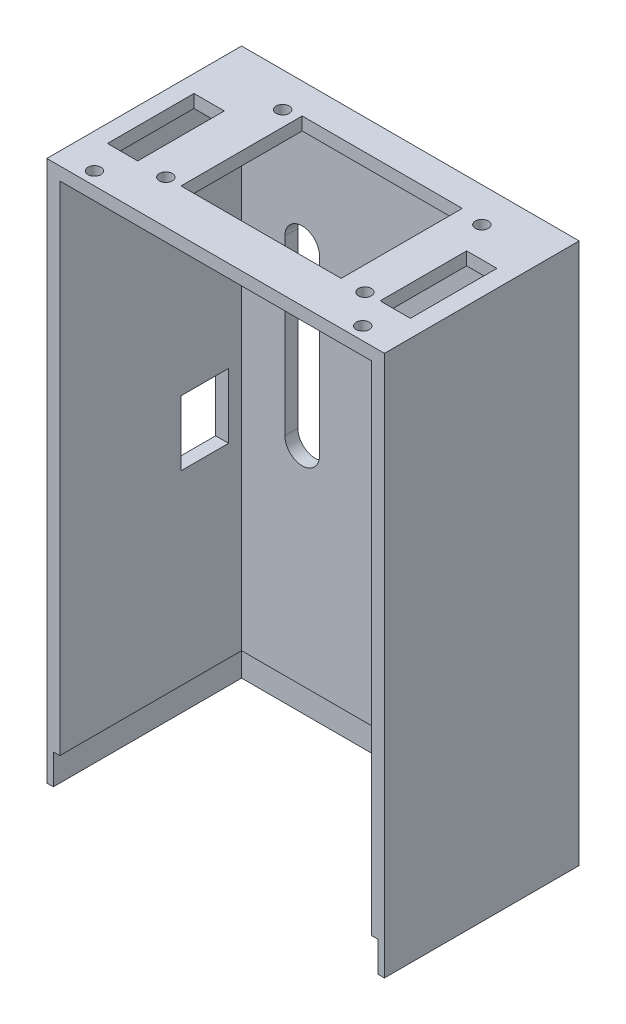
ISO-10303-21;
HEADER;
FILE_DESCRIPTION(('STEP AP214'),'2;1');
FILE_NAME('part.step','',(''),(''),'','','');
FILE_SCHEMA(('AUTOMOTIVE_DESIGN { 1 0 10303 214 1 1 1 1 }'));
ENDSEC;
DATA;
#1=APPLICATION_CONTEXT('core data for automotive mechanical design processes');
#2=APPLICATION_PROTOCOL_DEFINITION('international standard','automotive_design',2000,#1);
#3=PRODUCT_CONTEXT('',#1,'mechanical');
#4=PRODUCT('Part','Part','',(#3));
#5=PRODUCT_RELATED_PRODUCT_CATEGORY('part','',(#4));
#6=PRODUCT_DEFINITION_FORMATION('','',#4);
#7=PRODUCT_DEFINITION_CONTEXT('part definition',#1,'design');
#8=PRODUCT_DEFINITION('design','',#6,#7);
#9=PRODUCT_DEFINITION_SHAPE('','',#8);
#10=(LENGTH_UNIT() NAMED_UNIT(*) SI_UNIT(.MILLI.,.METRE.));
#11=(NAMED_UNIT(*) PLANE_ANGLE_UNIT() SI_UNIT($,.RADIAN.));
#12=(NAMED_UNIT(*) SI_UNIT($,.STERADIAN.) SOLID_ANGLE_UNIT());
#13=UNCERTAINTY_MEASURE_WITH_UNIT(LENGTH_MEASURE(1.E-05),#10,'distance_accuracy_value','');
#14=(GEOMETRIC_REPRESENTATION_CONTEXT(3) GLOBAL_UNCERTAINTY_ASSIGNED_CONTEXT((#13)) GLOBAL_UNIT_ASSIGNED_CONTEXT((#10,
#11,#12)) REPRESENTATION_CONTEXT('',''));
#15=CARTESIAN_POINT('',(0.,0.,0.));
#16=DIRECTION('',(0.,0.,1.));
#17=DIRECTION('',(1.,0.,0.));
#18=AXIS2_PLACEMENT_3D('',#15,#16,#17);
#19=CARTESIAN_POINT('',(39.,125.,3.));
#20=DIRECTION('',(-1.,0.,0.));
#21=DIRECTION('',(0.,-1.,0.));
#22=AXIS2_PLACEMENT_3D('',#19,#20,#21);
#23=PLANE('',#22);
#24=DIRECTION('',(0.,0.,-1.));
#25=VECTOR('',#24,1.);
#26=CARTESIAN_POINT('',(39.,0.,45.));
#27=LINE('',#26,#25);
#28=CARTESIAN_POINT('',(39.,0.,45.));
#29=VERTEX_POINT('',#28);
#30=CARTESIAN_POINT('',(39.,0.,0.));
#31=VERTEX_POINT('',#30);
#32=EDGE_CURVE('E332',#29,#31,#27,.T.);
#33=ORIENTED_EDGE('',*,*,#32,.T.);
#34=DIRECTION('',(0.,1.,0.));
#35=VECTOR('',#34,1.);
#36=CARTESIAN_POINT('',(39.,125.,0.));
#37=LINE('',#36,#35);
#38=CARTESIAN_POINT('',(39.,125.,0.));
#39=VERTEX_POINT('',#38);
#40=EDGE_CURVE('E511',#31,#39,#37,.T.);
#41=ORIENTED_EDGE('',*,*,#40,.T.);
#42=DIRECTION('',(0.,0.,-1.));
#43=VECTOR('',#42,1.);
#44=CARTESIAN_POINT('',(39.,125.,3.));
#45=LINE('',#44,#43);
#46=CARTESIAN_POINT('',(39.,125.,45.));
#47=VERTEX_POINT('',#46);
#48=EDGE_CURVE('E521',#47,#39,#45,.T.);
#49=ORIENTED_EDGE('',*,*,#48,.F.);
#50=DIRECTION('',(0.,1.,0.));
#51=VECTOR('',#50,1.);
#52=CARTESIAN_POINT('',(39.,-125.,45.));
#53=LINE('',#52,#51);
#54=EDGE_CURVE('E509',#29,#47,#53,.T.);
#55=ORIENTED_EDGE('',*,*,#54,.F.);
#56=EDGE_LOOP('',(#33,#41,#49,#55));
#57=FACE_BOUND('',#56,.T.);
#58=ADVANCED_FACE('F39',(#57),#23,.F.);
#59=CARTESIAN_POINT('',(-39.,125.,3.));
#60=DIRECTION('',(1.,0.,0.));
#61=DIRECTION('',(0.,1.,0.));
#62=AXIS2_PLACEMENT_3D('',#59,#60,#61);
#63=PLANE('',#62);
#64=DIRECTION('',(0.,0.,1.));
#65=VECTOR('',#64,1.);
#66=CARTESIAN_POINT('',(-39.,50.,6.));
#67=LINE('',#66,#65);
#68=CARTESIAN_POINT('',(-39.,50.,6.));
#69=VERTEX_POINT('',#68);
#70=CARTESIAN_POINT('',(-39.,50.,17.));
#71=VERTEX_POINT('',#70);
#72=EDGE_CURVE('E465',#69,#71,#67,.T.);
#73=ORIENTED_EDGE('',*,*,#72,.F.);
#74=DIRECTION('',(0.,-1.,0.));
#75=VECTOR('',#74,1.);
#76=CARTESIAN_POINT('',(-39.,65.,6.));
#77=LINE('',#76,#75);
#78=CARTESIAN_POINT('',(-39.,65.,6.));
#79=VERTEX_POINT('',#78);
#80=EDGE_CURVE('E463',#79,#69,#77,.T.);
#81=ORIENTED_EDGE('',*,*,#80,.F.);
#82=DIRECTION('',(0.,0.,-1.));
#83=VECTOR('',#82,1.);
#84=CARTESIAN_POINT('',(-39.,65.,6.));
#85=LINE('',#84,#83);
#86=CARTESIAN_POINT('',(-39.,65.,17.));
#87=VERTEX_POINT('',#86);
#88=EDGE_CURVE('E471',#87,#79,#85,.T.);
#89=ORIENTED_EDGE('',*,*,#88,.F.);
#90=DIRECTION('',(0.,1.,0.));
#91=VECTOR('',#90,1.);
#92=CARTESIAN_POINT('',(-39.,65.,17.));
#93=LINE('',#92,#91);
#94=EDGE_CURVE('E468',#71,#87,#93,.T.);
#95=ORIENTED_EDGE('',*,*,#94,.F.);
#96=EDGE_LOOP('',(#73,#81,#89,#95));
#97=FACE_BOUND('',#96,.T.);
#98=DIRECTION('',(0.,-1.,0.));
#99=VECTOR('',#98,1.);
#100=CARTESIAN_POINT('',(-39.,125.,0.));
#101=LINE('',#100,#99);
#102=CARTESIAN_POINT('',(-39.,125.,0.));
#103=VERTEX_POINT('',#102);
#104=CARTESIAN_POINT('',(-39.,0.,0.));
#105=VERTEX_POINT('',#104);
#106=EDGE_CURVE('E515',#103,#105,#101,.T.);
#107=ORIENTED_EDGE('',*,*,#106,.T.);
#108=DIRECTION('',(0.,0.,-1.));
#109=VECTOR('',#108,1.);
#110=CARTESIAN_POINT('',(-39.,0.,45.));
#111=LINE('',#110,#109);
#112=CARTESIAN_POINT('',(-39.,0.,45.));
#113=VERTEX_POINT('',#112);
#114=EDGE_CURVE('E330',#113,#105,#111,.T.);
#115=ORIENTED_EDGE('',*,*,#114,.F.);
#116=DIRECTION('',(0.,-1.,0.));
#117=VECTOR('',#116,1.);
#118=CARTESIAN_POINT('',(-39.,125.,45.));
#119=LINE('',#118,#117);
#120=CARTESIAN_POINT('',(-39.,125.,45.));
#121=VERTEX_POINT('',#120);
#122=EDGE_CURVE('E506',#121,#113,#119,.T.);
#123=ORIENTED_EDGE('',*,*,#122,.F.);
#124=DIRECTION('',(0.,0.,-1.));
#125=VECTOR('',#124,1.);
#126=CARTESIAN_POINT('',(-39.,125.,3.));
#127=LINE('',#126,#125);
#128=EDGE_CURVE('E518',#121,#103,#127,.T.);
#129=ORIENTED_EDGE('',*,*,#128,.T.);
#130=EDGE_LOOP('',(#107,#115,#123,#129));
#131=FACE_BOUND('',#130,.T.);
#132=ADVANCED_FACE('F660',(#97,#131),#63,.F.);
#133=CARTESIAN_POINT('',(0.,0.,45.));
#134=DIRECTION('',(0.,0.,1.));
#135=DIRECTION('',(1.,0.,0.));
#136=AXIS2_PLACEMENT_3D('',#133,#134,#135);
#137=PLANE('',#136);
#138=DIRECTION('',(0.,-1.,0.));
#139=VECTOR('',#138,1.);
#140=CARTESIAN_POINT('',(-37.5,0.,45.));
#141=LINE('',#140,#139);
#142=CARTESIAN_POINT('',(-37.5,7.,45.));
#143=VERTEX_POINT('',#142);
#144=CARTESIAN_POINT('',(-37.5,0.,45.));
#145=VERTEX_POINT('',#144);
#146=EDGE_CURVE('E300',#143,#145,#141,.T.);
#147=ORIENTED_EDGE('',*,*,#146,.F.);
#148=DIRECTION('',(-1.,0.,0.));
#149=VECTOR('',#148,1.);
#150=CARTESIAN_POINT('',(-37.5,7.,45.));
#151=LINE('',#150,#149);
#152=CARTESIAN_POINT('',(-36.,7.,45.));
#153=VERTEX_POINT('',#152);
#154=EDGE_CURVE('E291',#153,#143,#151,.T.);
#155=ORIENTED_EDGE('',*,*,#154,.F.);
#156=DIRECTION('',(0.,-1.,0.));
#157=VECTOR('',#156,1.);
#158=CARTESIAN_POINT('',(-36.,122.,45.));
#159=LINE('',#158,#157);
#160=CARTESIAN_POINT('',(-36.,122.,45.));
#161=VERTEX_POINT('',#160);
#162=EDGE_CURVE('E486',#161,#153,#159,.T.);
#163=ORIENTED_EDGE('',*,*,#162,.F.);
#164=DIRECTION('',(-1.,0.,0.));
#165=VECTOR('',#164,1.);
#166=CARTESIAN_POINT('',(36.,122.,45.));
#167=LINE('',#166,#165);
#168=CARTESIAN_POINT('',(36.,122.,45.));
#169=VERTEX_POINT('',#168);
#170=EDGE_CURVE('E484',#169,#161,#167,.T.);
#171=ORIENTED_EDGE('',*,*,#170,.F.);
#172=DIRECTION('',(0.,1.,0.));
#173=VECTOR('',#172,1.);
#174=CARTESIAN_POINT('',(36.,-122.,45.));
#175=LINE('',#174,#173);
#176=CARTESIAN_POINT('',(36.,7.,45.));
#177=VERTEX_POINT('',#176);
#178=EDGE_CURVE('E490',#177,#169,#175,.T.);
#179=ORIENTED_EDGE('',*,*,#178,.F.);
#180=DIRECTION('',(-1.,0.,0.));
#181=VECTOR('',#180,1.);
#182=CARTESIAN_POINT('',(36.,7.,45.));
#183=LINE('',#182,#181);
#184=CARTESIAN_POINT('',(37.5,7.,45.));
#185=VERTEX_POINT('',#184);
#186=EDGE_CURVE('E316',#185,#177,#183,.T.);
#187=ORIENTED_EDGE('',*,*,#186,.F.);
#188=DIRECTION('',(0.,1.,0.));
#189=VECTOR('',#188,1.);
#190=CARTESIAN_POINT('',(37.5,7.,45.));
#191=LINE('',#190,#189);
#192=CARTESIAN_POINT('',(37.5,0.,45.));
#193=VERTEX_POINT('',#192);
#194=EDGE_CURVE('E305',#193,#185,#191,.T.);
#195=ORIENTED_EDGE('',*,*,#194,.F.);
#196=DIRECTION('',(-1.,0.,0.));
#197=VECTOR('',#196,1.);
#198=CARTESIAN_POINT('',(36.,0.,45.));
#199=LINE('',#198,#197);
#200=EDGE_CURVE('E325',#29,#193,#199,.T.);
#201=ORIENTED_EDGE('',*,*,#200,.F.);
#202=ORIENTED_EDGE('',*,*,#54,.T.);
#203=DIRECTION('',(-1.,0.,0.));
#204=VECTOR('',#203,1.);
#205=CARTESIAN_POINT('',(39.,125.,45.));
#206=LINE('',#205,#204);
#207=EDGE_CURVE('E503',#47,#121,#206,.T.);
#208=ORIENTED_EDGE('',*,*,#207,.T.);
#209=ORIENTED_EDGE('',*,*,#122,.T.);
#210=DIRECTION('',(-1.,0.,0.));
#211=VECTOR('',#210,1.);
#212=CARTESIAN_POINT('',(-39.,0.,45.));
#213=LINE('',#212,#211);
#214=EDGE_CURVE('E328',#145,#113,#213,.T.);
#215=ORIENTED_EDGE('',*,*,#214,.F.);
#216=EDGE_LOOP('',(#147,#155,#163,#171,#179,#187,#195,#201,#202,#208,#209,#215));
#217=FACE_BOUND('',#216,.T.);
#218=ADVANCED_FACE('F632',(#217),#137,.T.);
#219=CARTESIAN_POINT('',(-36.,122.,45.));
#220=DIRECTION('',(1.,0.,0.));
#221=DIRECTION('',(0.,1.,0.));
#222=AXIS2_PLACEMENT_3D('',#219,#220,#221);
#223=PLANE('',#222);
#224=DIRECTION('',(0.,0.,1.));
#225=VECTOR('',#224,1.);
#226=CARTESIAN_POINT('',(-36.,7.,1.50000000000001));
#227=LINE('',#226,#225);
#228=CARTESIAN_POINT('',(-36.,7.,3.));
#229=VERTEX_POINT('',#228);
#230=EDGE_CURVE('E295',#229,#153,#227,.T.);
#231=ORIENTED_EDGE('',*,*,#230,.F.);
#232=DIRECTION('',(0.,-1.,0.));
#233=VECTOR('',#232,1.);
#234=CARTESIAN_POINT('',(-36.,122.,3.));
#235=LINE('',#234,#233);
#236=CARTESIAN_POINT('',(-36.,122.,3.));
#237=VERTEX_POINT('',#236);
#238=EDGE_CURVE('E494',#237,#229,#235,.T.);
#239=ORIENTED_EDGE('',*,*,#238,.F.);
#240=DIRECTION('',(0.,0.,-1.));
#241=VECTOR('',#240,1.);
#242=CARTESIAN_POINT('',(-36.,122.,45.));
#243=LINE('',#242,#241);
#244=EDGE_CURVE('E500',#161,#237,#243,.T.);
#245=ORIENTED_EDGE('',*,*,#244,.F.);
#246=ORIENTED_EDGE('',*,*,#162,.T.);
#247=EDGE_LOOP('',(#231,#239,#245,#246));
#248=FACE_BOUND('',#247,.T.);
#249=DIRECTION('',(0.,1.,0.));
#250=VECTOR('',#249,1.);
#251=CARTESIAN_POINT('',(-36.,122.,5.99999999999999));
#252=LINE('',#251,#250);
#253=CARTESIAN_POINT('',(-36.,50.,6.));
#254=VERTEX_POINT('',#253);
#255=CARTESIAN_POINT('',(-36.,65.,6.));
#256=VERTEX_POINT('',#255);
#257=EDGE_CURVE('E531',#254,#256,#252,.T.);
#258=ORIENTED_EDGE('',*,*,#257,.F.);
#259=DIRECTION('',(0.,0.,-1.));
#260=VECTOR('',#259,1.);
#261=CARTESIAN_POINT('',(-36.,50.,45.));
#262=LINE('',#261,#260);
#263=CARTESIAN_POINT('',(-36.,50.,17.));
#264=VERTEX_POINT('',#263);
#265=EDGE_CURVE('E524',#264,#254,#262,.T.);
#266=ORIENTED_EDGE('',*,*,#265,.F.);
#267=DIRECTION('',(0.,-1.,0.));
#268=VECTOR('',#267,1.);
#269=CARTESIAN_POINT('',(-36.,122.,17.));
#270=LINE('',#269,#268);
#271=CARTESIAN_POINT('',(-36.,65.,17.));
#272=VERTEX_POINT('',#271);
#273=EDGE_CURVE('E526',#272,#264,#270,.T.);
#274=ORIENTED_EDGE('',*,*,#273,.F.);
#275=DIRECTION('',(0.,0.,1.));
#276=VECTOR('',#275,1.);
#277=CARTESIAN_POINT('',(-36.,64.9999999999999,44.9999999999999));
#278=LINE('',#277,#276);
#279=EDGE_CURVE('E529',#256,#272,#278,.T.);
#280=ORIENTED_EDGE('',*,*,#279,.F.);
#281=EDGE_LOOP('',(#258,#266,#274,#280));
#282=FACE_BOUND('',#281,.T.);
#283=ADVANCED_FACE('F636',(#248,#282),#223,.T.);
#284=CARTESIAN_POINT('',(36.,-122.,45.));
#285=DIRECTION('',(-1.,0.,0.));
#286=DIRECTION('',(0.,-1.,0.));
#287=AXIS2_PLACEMENT_3D('',#284,#285,#286);
#288=PLANE('',#287);
#289=DIRECTION('',(0.,0.,1.));
#290=VECTOR('',#289,1.);
#291=CARTESIAN_POINT('',(36.,7.,1.50000000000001));
#292=LINE('',#291,#290);
#293=CARTESIAN_POINT('',(36.,7.,3.));
#294=VERTEX_POINT('',#293);
#295=EDGE_CURVE('E311',#294,#177,#292,.T.);
#296=ORIENTED_EDGE('',*,*,#295,.T.);
#297=ORIENTED_EDGE('',*,*,#178,.T.);
#298=DIRECTION('',(0.,0.,-1.));
#299=VECTOR('',#298,1.);
#300=CARTESIAN_POINT('',(36.,122.,45.));
#301=LINE('',#300,#299);
#302=CARTESIAN_POINT('',(36.,122.,3.));
#303=VERTEX_POINT('',#302);
#304=EDGE_CURVE('E492',#169,#303,#301,.T.);
#305=ORIENTED_EDGE('',*,*,#304,.T.);
#306=DIRECTION('',(0.,1.,0.));
#307=VECTOR('',#306,1.);
#308=CARTESIAN_POINT('',(36.,-122.,3.));
#309=LINE('',#308,#307);
#310=EDGE_CURVE('E487',#294,#303,#309,.T.);
#311=ORIENTED_EDGE('',*,*,#310,.F.);
#312=EDGE_LOOP('',(#296,#297,#305,#311));
#313=FACE_BOUND('',#312,.T.);
#314=ADVANCED_FACE('F628',(#313),#288,.T.);
#315=CARTESIAN_POINT('',(-39.,125.,3.));
#316=DIRECTION('',(0.,-1.,0.));
#317=DIRECTION('',(0.,0.,-1.));
#318=AXIS2_PLACEMENT_3D('',#315,#316,#317);
#319=PLANE('',#318);
#320=CARTESIAN_POINT('',(24.5044087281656,125.,7.99999999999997));
#321=DIRECTION('',(0.,1.,0.));
#322=DIRECTION('',(0.,0.,1.));
#323=AXIS2_PLACEMENT_3D('',#320,#321,#322);
#324=CIRCLE('',#323,1.5);
#325=CARTESIAN_POINT('',(24.5044087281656,125.,9.49999999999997));
#326=VERTEX_POINT('',#325);
#327=EDGE_CURVE('E338',#326,#326,#324,.T.);
#328=ORIENTED_EDGE('',*,*,#327,.F.);
#329=EDGE_LOOP('',(#328));
#330=FACE_BOUND('',#329,.T.);
#331=CARTESIAN_POINT('',(-21.5044087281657,125.,35.));
#332=DIRECTION('',(0.,1.,0.));
#333=DIRECTION('',(0.,0.,1.));
#334=AXIS2_PLACEMENT_3D('',#331,#332,#333);
#335=CIRCLE('',#334,1.5);
#336=CARTESIAN_POINT('',(-21.5044087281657,125.,36.5));
#337=VERTEX_POINT('',#336);
#338=EDGE_CURVE('E337',#337,#337,#335,.T.);
#339=ORIENTED_EDGE('',*,*,#338,.F.);
#340=EDGE_LOOP('',(#339));
#341=FACE_BOUND('',#340,.T.);
#342=CARTESIAN_POINT('',(24.5044087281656,125.,35.));
#343=DIRECTION('',(0.,1.,0.));
#344=DIRECTION('',(0.,0.,1.));
#345=AXIS2_PLACEMENT_3D('',#342,#343,#344);
#346=CIRCLE('',#345,1.5);
#347=CARTESIAN_POINT('',(24.5044087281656,125.,36.5));
#348=VERTEX_POINT('',#347);
#349=EDGE_CURVE('E334',#348,#348,#346,.T.);
#350=ORIENTED_EDGE('',*,*,#349,.F.);
#351=EDGE_LOOP('',(#350));
#352=FACE_BOUND('',#351,.T.);
#353=CARTESIAN_POINT('',(-21.5044087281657,125.,7.99999999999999));
#354=DIRECTION('',(0.,1.,0.));
#355=DIRECTION('',(0.,0.,1.));
#356=AXIS2_PLACEMENT_3D('',#353,#354,#355);
#357=CIRCLE('',#356,1.5);
#358=CARTESIAN_POINT('',(-21.5044087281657,125.,9.49999999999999));
#359=VERTEX_POINT('',#358);
#360=EDGE_CURVE('E341',#359,#359,#357,.T.);
#361=ORIENTED_EDGE('',*,*,#360,.F.);
#362=EDGE_LOOP('',(#361));
#363=FACE_BOUND('',#362,.T.);
#364=DIRECTION('',(-1.,0.,0.));
#365=VECTOR('',#364,1.);
#366=CARTESIAN_POINT('',(-35.,125.,15.));
#367=LINE('',#366,#365);
#368=CARTESIAN_POINT('',(-28.,125.,15.));
#369=VERTEX_POINT('',#368);
#370=CARTESIAN_POINT('',(-35.,125.,15.));
#371=VERTEX_POINT('',#370);
#372=EDGE_CURVE('E348',#369,#371,#367,.T.);
#373=ORIENTED_EDGE('',*,*,#372,.F.);
#374=DIRECTION('',(0.,0.,-1.));
#375=VECTOR('',#374,1.);
#376=CARTESIAN_POINT('',(-28.,125.,35.));
#377=LINE('',#376,#375);
#378=CARTESIAN_POINT('',(-28.,125.,35.));
#379=VERTEX_POINT('',#378);
#380=EDGE_CURVE('E55',#379,#369,#377,.T.);
#381=ORIENTED_EDGE('',*,*,#380,.F.);
#382=DIRECTION('',(1.,0.,0.));
#383=VECTOR('',#382,1.);
#384=CARTESIAN_POINT('',(-35.,125.,35.));
#385=LINE('',#384,#383);
#386=CARTESIAN_POINT('',(-35.,125.,35.));
#387=VERTEX_POINT('',#386);
#388=EDGE_CURVE('E354',#387,#379,#385,.T.);
#389=ORIENTED_EDGE('',*,*,#388,.F.);
#390=DIRECTION('',(0.,0.,1.));
#391=VECTOR('',#390,1.);
#392=CARTESIAN_POINT('',(-35.,125.,35.));
#393=LINE('',#392,#391);
#394=EDGE_CURVE('E351',#371,#387,#393,.T.);
#395=ORIENTED_EDGE('',*,*,#394,.F.);
#396=EDGE_LOOP('',(#373,#381,#389,#395));
#397=FACE_BOUND('',#396,.T.);
#398=DIRECTION('',(-1.,0.,0.));
#399=VECTOR('',#398,1.);
#400=CARTESIAN_POINT('',(28.,125.,15.));
#401=LINE('',#400,#399);
#402=CARTESIAN_POINT('',(35.,125.,15.));
#403=VERTEX_POINT('',#402);
#404=CARTESIAN_POINT('',(28.,125.,15.));
#405=VERTEX_POINT('',#404);
#406=EDGE_CURVE('E380',#403,#405,#401,.T.);
#407=ORIENTED_EDGE('',*,*,#406,.F.);
#408=DIRECTION('',(0.,0.,-1.));
#409=VECTOR('',#408,1.);
#410=CARTESIAN_POINT('',(35.,125.,15.));
#411=LINE('',#410,#409);
#412=CARTESIAN_POINT('',(35.,125.,35.));
#413=VERTEX_POINT('',#412);
#414=EDGE_CURVE('E63',#413,#403,#411,.T.);
#415=ORIENTED_EDGE('',*,*,#414,.F.);
#416=DIRECTION('',(1.,0.,0.));
#417=VECTOR('',#416,1.);
#418=CARTESIAN_POINT('',(28.,125.,35.));
#419=LINE('',#418,#417);
#420=CARTESIAN_POINT('',(28.,125.,35.));
#421=VERTEX_POINT('',#420);
#422=EDGE_CURVE('E368',#421,#413,#419,.T.);
#423=ORIENTED_EDGE('',*,*,#422,.F.);
#424=DIRECTION('',(0.,0.,1.));
#425=VECTOR('',#424,1.);
#426=CARTESIAN_POINT('',(28.,125.,15.));
#427=LINE('',#426,#425);
#428=EDGE_CURVE('E377',#405,#421,#427,.T.);
#429=ORIENTED_EDGE('',*,*,#428,.F.);
#430=EDGE_LOOP('',(#407,#415,#423,#429));
#431=FACE_BOUND('',#430,.T.);
#432=DIRECTION('',(0.,0.,-1.));
#433=VECTOR('',#432,1.);
#434=CARTESIAN_POINT('',(19.,125.,7.));
#435=LINE('',#434,#433);
#436=CARTESIAN_POINT('',(19.,125.,35.));
#437=VERTEX_POINT('',#436);
#438=CARTESIAN_POINT('',(19.,125.,7.));
#439=VERTEX_POINT('',#438);
#440=EDGE_CURVE('E385',#437,#439,#435,.T.);
#441=ORIENTED_EDGE('',*,*,#440,.F.);
#442=DIRECTION('',(1.,0.,0.));
#443=VECTOR('',#442,1.);
#444=CARTESIAN_POINT('',(19.,125.,35.));
#445=LINE('',#444,#443);
#446=CARTESIAN_POINT('',(-18.,125.,35.));
#447=VERTEX_POINT('',#446);
#448=EDGE_CURVE('E360',#447,#437,#445,.T.);
#449=ORIENTED_EDGE('',*,*,#448,.F.);
#450=DIRECTION('',(0.,0.,1.));
#451=VECTOR('',#450,1.);
#452=CARTESIAN_POINT('',(-18.,125.,35.));
#453=LINE('',#452,#451);
#454=CARTESIAN_POINT('',(-18.,125.,7.));
#455=VERTEX_POINT('',#454);
#456=EDGE_CURVE('E391',#455,#447,#453,.T.);
#457=ORIENTED_EDGE('',*,*,#456,.F.);
#458=DIRECTION('',(-1.,0.,0.));
#459=VECTOR('',#458,1.);
#460=CARTESIAN_POINT('',(-18.,125.,7.));
#461=LINE('',#460,#459);
#462=EDGE_CURVE('E388',#439,#455,#461,.T.);
#463=ORIENTED_EDGE('',*,*,#462,.F.);
#464=EDGE_LOOP('',(#441,#449,#457,#463));
#465=FACE_BOUND('',#464,.T.);
#466=CARTESIAN_POINT('',(-31.,125.,42.));
#467=DIRECTION('',(0.,-1.,0.));
#468=DIRECTION('',(0.,0.,-1.));
#469=AXIS2_PLACEMENT_3D('',#466,#467,#468);
#470=CIRCLE('',#469,1.5);
#471=CARTESIAN_POINT('',(-31.,125.,40.5));
#472=VERTEX_POINT('',#471);
#473=EDGE_CURVE('E452',#472,#472,#470,.T.);
#474=ORIENTED_EDGE('',*,*,#473,.T.);
#475=EDGE_LOOP('',(#474));
#476=FACE_BOUND('',#475,.T.);
#477=CARTESIAN_POINT('',(31.,125.,42.));
#478=DIRECTION('',(0.,-1.,0.));
#479=DIRECTION('',(0.,0.,-1.));
#480=AXIS2_PLACEMENT_3D('',#477,#478,#479);
#481=CIRCLE('',#480,1.5);
#482=CARTESIAN_POINT('',(31.,125.,40.5));
#483=VERTEX_POINT('',#482);
#484=EDGE_CURVE('E445',#483,#483,#481,.T.);
#485=ORIENTED_EDGE('',*,*,#484,.T.);
#486=EDGE_LOOP('',(#485));
#487=FACE_BOUND('',#486,.T.);
#488=DIRECTION('',(-1.,0.,0.));
#489=VECTOR('',#488,1.);
#490=CARTESIAN_POINT('',(-39.,125.,0.));
#491=LINE('',#490,#489);
#492=EDGE_CURVE('E513',#39,#103,#491,.T.);
#493=ORIENTED_EDGE('',*,*,#492,.T.);
#494=ORIENTED_EDGE('',*,*,#128,.F.);
#495=ORIENTED_EDGE('',*,*,#207,.F.);
#496=ORIENTED_EDGE('',*,*,#48,.T.);
#497=EDGE_LOOP('',(#493,#494,#495,#496));
#498=FACE_BOUND('',#497,.T.);
#499=ADVANCED_FACE('F656',(#330,#341,#352,#363,#397,#431,#465,#476,#487,#498),#319,.F.);
#500=CARTESIAN_POINT('',(0.,0.,0.));
#501=DIRECTION('',(0.,0.,1.));
#502=DIRECTION('',(1.,0.,0.));
#503=AXIS2_PLACEMENT_3D('',#500,#501,#502);
#504=PLANE('',#503);
#505=CARTESIAN_POINT('',(-30.,115.,0.));
#506=DIRECTION('',(0.,0.,-1.));
#507=DIRECTION('',(-1.,0.,0.));
#508=AXIS2_PLACEMENT_3D('',#505,#506,#507);
#509=CIRCLE('',#508,1.5);
#510=CARTESIAN_POINT('',(-31.5,115.,0.));
#511=VERTEX_POINT('',#510);
#512=EDGE_CURVE('E397',#511,#511,#509,.T.);
#513=ORIENTED_EDGE('',*,*,#512,.F.);
#514=EDGE_LOOP('',(#513));
#515=FACE_BOUND('',#514,.T.);
#516=CARTESIAN_POINT('',(30.,115.,0.));
#517=DIRECTION('',(0.,0.,-1.));
#518=DIRECTION('',(-1.,0.,0.));
#519=AXIS2_PLACEMENT_3D('',#516,#517,#518);
#520=CIRCLE('',#519,1.5);
#521=CARTESIAN_POINT('',(28.5,115.,0.));
#522=VERTEX_POINT('',#521);
#523=EDGE_CURVE('E406',#522,#522,#520,.T.);
#524=ORIENTED_EDGE('',*,*,#523,.F.);
#525=EDGE_LOOP('',(#524));
#526=FACE_BOUND('',#525,.T.);
#527=DIRECTION('',(0.,-1.,0.));
#528=VECTOR('',#527,1.);
#529=CARTESIAN_POINT('',(26.,95.,0.));
#530=LINE('',#529,#528);
#531=CARTESIAN_POINT('',(26.,95.,0.));
#532=VERTEX_POINT('',#531);
#533=CARTESIAN_POINT('',(26.,55.,0.));
#534=VERTEX_POINT('',#533);
#535=EDGE_CURVE('E426',#532,#534,#530,.T.);
#536=ORIENTED_EDGE('',*,*,#535,.F.);
#537=CARTESIAN_POINT('',(22.,95.,0.));
#538=DIRECTION('',(0.,0.,-1.));
#539=DIRECTION('',(-1.,0.,0.));
#540=AXIS2_PLACEMENT_3D('',#537,#538,#539);
#541=CIRCLE('',#540,4.);
#542=CARTESIAN_POINT('',(18.,95.,0.));
#543=VERTEX_POINT('',#542);
#544=EDGE_CURVE('E429',#543,#532,#541,.T.);
#545=ORIENTED_EDGE('',*,*,#544,.F.);
#546=DIRECTION('',(0.,1.,0.));
#547=VECTOR('',#546,1.);
#548=CARTESIAN_POINT('',(18.,95.,0.));
#549=LINE('',#548,#547);
#550=CARTESIAN_POINT('',(18.,55.,0.));
#551=VERTEX_POINT('',#550);
#552=EDGE_CURVE('E413',#551,#543,#549,.T.);
#553=ORIENTED_EDGE('',*,*,#552,.F.);
#554=CARTESIAN_POINT('',(22.,55.,0.));
#555=DIRECTION('',(0.,0.,-1.));
#556=DIRECTION('',(-1.,0.,0.));
#557=AXIS2_PLACEMENT_3D('',#554,#555,#556);
#558=CIRCLE('',#557,4.);
#559=EDGE_CURVE('E423',#534,#551,#558,.T.);
#560=ORIENTED_EDGE('',*,*,#559,.F.);
#561=EDGE_LOOP('',(#536,#545,#553,#560));
#562=FACE_BOUND('',#561,.T.);
#563=DIRECTION('',(0.,-1.,0.));
#564=VECTOR('',#563,1.);
#565=CARTESIAN_POINT('',(-18.,95.,0.));
#566=LINE('',#565,#564);
#567=CARTESIAN_POINT('',(-18.,95.,0.));
#568=VERTEX_POINT('',#567);
#569=CARTESIAN_POINT('',(-18.,55.,0.));
#570=VERTEX_POINT('',#569);
#571=EDGE_CURVE('E433',#568,#570,#566,.T.);
#572=ORIENTED_EDGE('',*,*,#571,.F.);
#573=CARTESIAN_POINT('',(-22.,95.,0.));
#574=DIRECTION('',(0.,0.,-1.));
#575=DIRECTION('',(-1.,0.,0.));
#576=AXIS2_PLACEMENT_3D('',#573,#574,#575);
#577=CIRCLE('',#576,4.);
#578=CARTESIAN_POINT('',(-26.,95.,0.));
#579=VERTEX_POINT('',#578);
#580=EDGE_CURVE('E431',#579,#568,#577,.T.);
#581=ORIENTED_EDGE('',*,*,#580,.F.);
#582=DIRECTION('',(0.,1.,0.));
#583=VECTOR('',#582,1.);
#584=CARTESIAN_POINT('',(-26.,95.,0.));
#585=LINE('',#584,#583);
#586=CARTESIAN_POINT('',(-26.,55.,0.));
#587=VERTEX_POINT('',#586);
#588=EDGE_CURVE('E439',#587,#579,#585,.T.);
#589=ORIENTED_EDGE('',*,*,#588,.F.);
#590=CARTESIAN_POINT('',(-22.,55.,0.));
#591=DIRECTION('',(0.,0.,-1.));
#592=DIRECTION('',(-1.,0.,0.));
#593=AXIS2_PLACEMENT_3D('',#590,#591,#592);
#594=CIRCLE('',#593,4.);
#595=EDGE_CURVE('E436',#570,#587,#594,.T.);
#596=ORIENTED_EDGE('',*,*,#595,.F.);
#597=EDGE_LOOP('',(#572,#581,#589,#596));
#598=FACE_BOUND('',#597,.T.);
#599=ORIENTED_EDGE('',*,*,#40,.F.);
#600=DIRECTION('',(-1.,0.,0.));
#601=VECTOR('',#600,1.);
#602=CARTESIAN_POINT('',(39.,0.,0.));
#603=LINE('',#602,#601);
#604=EDGE_CURVE('E283',#31,#105,#603,.T.);
#605=ORIENTED_EDGE('',*,*,#604,.T.);
#606=ORIENTED_EDGE('',*,*,#106,.F.);
#607=ORIENTED_EDGE('',*,*,#492,.F.);
#608=EDGE_LOOP('',(#599,#605,#606,#607));
#609=FACE_BOUND('',#608,.T.);
#610=ADVANCED_FACE('F597',(#515,#526,#562,#598,#609),#504,.F.);
#611=CARTESIAN_POINT('',(36.,122.,45.));
#612=DIRECTION('',(0.,-1.,0.));
#613=DIRECTION('',(0.,0.,-1.));
#614=AXIS2_PLACEMENT_3D('',#611,#612,#613);
#615=PLANE('',#614);
#616=CARTESIAN_POINT('',(24.5044087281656,122.,7.99999999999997));
#617=DIRECTION('',(0.,-1.,0.));
#618=DIRECTION('',(0.,0.,-1.));
#619=AXIS2_PLACEMENT_3D('',#616,#617,#618);
#620=CIRCLE('',#619,1.5);
#621=CARTESIAN_POINT('',(24.5044087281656,122.,6.49999999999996));
#622=VERTEX_POINT('',#621);
#623=EDGE_CURVE('E42',#622,#622,#620,.T.);
#624=ORIENTED_EDGE('',*,*,#623,.F.);
#625=EDGE_LOOP('',(#624));
#626=FACE_BOUND('',#625,.T.);
#627=CARTESIAN_POINT('',(-21.5044087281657,122.,35.));
#628=DIRECTION('',(0.,-1.,0.));
#629=DIRECTION('',(0.,0.,-1.));
#630=AXIS2_PLACEMENT_3D('',#627,#628,#629);
#631=CIRCLE('',#630,1.5);
#632=CARTESIAN_POINT('',(-21.5044087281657,122.,33.5));
#633=VERTEX_POINT('',#632);
#634=EDGE_CURVE('E583',#633,#633,#631,.T.);
#635=ORIENTED_EDGE('',*,*,#634,.F.);
#636=EDGE_LOOP('',(#635));
#637=FACE_BOUND('',#636,.T.);
#638=CARTESIAN_POINT('',(24.5044087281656,122.,35.));
#639=DIRECTION('',(0.,-1.,0.));
#640=DIRECTION('',(0.,0.,-1.));
#641=AXIS2_PLACEMENT_3D('',#638,#639,#640);
#642=CIRCLE('',#641,1.5);
#643=CARTESIAN_POINT('',(24.5044087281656,122.,33.5));
#644=VERTEX_POINT('',#643);
#645=EDGE_CURVE('E581',#644,#644,#642,.T.);
#646=ORIENTED_EDGE('',*,*,#645,.F.);
#647=EDGE_LOOP('',(#646));
#648=FACE_BOUND('',#647,.T.);
#649=CARTESIAN_POINT('',(-21.5044087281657,122.,7.99999999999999));
#650=DIRECTION('',(0.,-1.,0.));
#651=DIRECTION('',(0.,0.,-1.));
#652=AXIS2_PLACEMENT_3D('',#649,#650,#651);
#653=CIRCLE('',#652,1.5);
#654=CARTESIAN_POINT('',(-21.5044087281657,122.,6.49999999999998));
#655=VERTEX_POINT('',#654);
#656=EDGE_CURVE('E346',#655,#655,#653,.T.);
#657=ORIENTED_EDGE('',*,*,#656,.F.);
#658=EDGE_LOOP('',(#657));
#659=FACE_BOUND('',#658,.T.);
#660=DIRECTION('',(0.,0.,1.));
#661=VECTOR('',#660,1.);
#662=CARTESIAN_POINT('',(-28.,122.,45.));
#663=LINE('',#662,#661);
#664=CARTESIAN_POINT('',(-28.,122.,15.));
#665=VERTEX_POINT('',#664);
#666=CARTESIAN_POINT('',(-28.,122.,35.));
#667=VERTEX_POINT('',#666);
#668=EDGE_CURVE('E11',#665,#667,#663,.T.);
#669=ORIENTED_EDGE('',*,*,#668,.F.);
#670=DIRECTION('',(1.,0.,0.));
#671=VECTOR('',#670,1.);
#672=CARTESIAN_POINT('',(36.,122.,15.));
#673=LINE('',#672,#671);
#674=CARTESIAN_POINT('',(-35.,122.,15.));
#675=VERTEX_POINT('',#674);
#676=EDGE_CURVE('E573',#675,#665,#673,.T.);
#677=ORIENTED_EDGE('',*,*,#676,.F.);
#678=DIRECTION('',(0.,0.,-1.));
#679=VECTOR('',#678,1.);
#680=CARTESIAN_POINT('',(-35.,122.,45.));
#681=LINE('',#680,#679);
#682=CARTESIAN_POINT('',(-35.,122.,35.));
#683=VERTEX_POINT('',#682);
#684=EDGE_CURVE('E575',#683,#675,#681,.T.);
#685=ORIENTED_EDGE('',*,*,#684,.F.);
#686=DIRECTION('',(-1.,0.,0.));
#687=VECTOR('',#686,1.);
#688=CARTESIAN_POINT('',(36.,122.,35.));
#689=LINE('',#688,#687);
#690=EDGE_CURVE('E47',#667,#683,#689,.T.);
#691=ORIENTED_EDGE('',*,*,#690,.F.);
#692=EDGE_LOOP('',(#669,#677,#685,#691));
#693=FACE_BOUND('',#692,.T.);
#694=DIRECTION('',(0.,0.,1.));
#695=VECTOR('',#694,1.);
#696=CARTESIAN_POINT('',(35.,122.,45.));
#697=LINE('',#696,#695);
#698=CARTESIAN_POINT('',(35.,122.,15.));
#699=VERTEX_POINT('',#698);
#700=CARTESIAN_POINT('',(35.,122.,35.));
#701=VERTEX_POINT('',#700);
#702=EDGE_CURVE('E571',#699,#701,#697,.T.);
#703=ORIENTED_EDGE('',*,*,#702,.F.);
#704=DIRECTION('',(1.,0.,0.));
#705=VECTOR('',#704,1.);
#706=CARTESIAN_POINT('',(36.,122.,15.));
#707=LINE('',#706,#705);
#708=CARTESIAN_POINT('',(28.,122.,15.));
#709=VERTEX_POINT('',#708);
#710=EDGE_CURVE('E564',#709,#699,#707,.T.);
#711=ORIENTED_EDGE('',*,*,#710,.F.);
#712=DIRECTION('',(0.,0.,-1.));
#713=VECTOR('',#712,1.);
#714=CARTESIAN_POINT('',(28.,122.,45.));
#715=LINE('',#714,#713);
#716=CARTESIAN_POINT('',(28.,122.,35.));
#717=VERTEX_POINT('',#716);
#718=EDGE_CURVE('E566',#717,#709,#715,.T.);
#719=ORIENTED_EDGE('',*,*,#718,.F.);
#720=DIRECTION('',(-1.,0.,0.));
#721=VECTOR('',#720,1.);
#722=CARTESIAN_POINT('',(36.,122.,35.));
#723=LINE('',#722,#721);
#724=EDGE_CURVE('E569',#701,#717,#723,.T.);
#725=ORIENTED_EDGE('',*,*,#724,.F.);
#726=EDGE_LOOP('',(#703,#711,#719,#725));
#727=FACE_BOUND('',#726,.T.);
#728=DIRECTION('',(-1.,0.,0.));
#729=VECTOR('',#728,1.);
#730=CARTESIAN_POINT('',(36.,122.,35.));
#731=LINE('',#730,#729);
#732=CARTESIAN_POINT('',(19.,122.,35.));
#733=VERTEX_POINT('',#732);
#734=CARTESIAN_POINT('',(-18.,122.,35.));
#735=VERTEX_POINT('',#734);
#736=EDGE_CURVE('E562',#733,#735,#731,.T.);
#737=ORIENTED_EDGE('',*,*,#736,.F.);
#738=DIRECTION('',(0.,0.,1.));
#739=VECTOR('',#738,1.);
#740=CARTESIAN_POINT('',(19.,122.,45.));
#741=LINE('',#740,#739);
#742=CARTESIAN_POINT('',(19.,122.,7.));
#743=VERTEX_POINT('',#742);
#744=EDGE_CURVE('E551',#743,#733,#741,.T.);
#745=ORIENTED_EDGE('',*,*,#744,.F.);
#746=DIRECTION('',(1.,0.,0.));
#747=VECTOR('',#746,1.);
#748=CARTESIAN_POINT('',(36.,122.,7.));
#749=LINE('',#748,#747);
#750=CARTESIAN_POINT('',(-18.,122.,7.));
#751=VERTEX_POINT('',#750);
#752=EDGE_CURVE('E557',#751,#743,#749,.T.);
#753=ORIENTED_EDGE('',*,*,#752,.F.);
#754=DIRECTION('',(0.,0.,-1.));
#755=VECTOR('',#754,1.);
#756=CARTESIAN_POINT('',(-18.,122.,45.));
#757=LINE('',#756,#755);
#758=EDGE_CURVE('E560',#735,#751,#757,.T.);
#759=ORIENTED_EDGE('',*,*,#758,.F.);
#760=EDGE_LOOP('',(#737,#745,#753,#759));
#761=FACE_BOUND('',#760,.T.);
#762=CARTESIAN_POINT('',(-31.,122.,42.));
#763=DIRECTION('',(0.,-1.,0.));
#764=DIRECTION('',(0.,0.,-1.));
#765=AXIS2_PLACEMENT_3D('',#762,#763,#764);
#766=CIRCLE('',#765,1.5);
#767=CARTESIAN_POINT('',(-31.,122.,40.5));
#768=VERTEX_POINT('',#767);
#769=EDGE_CURVE('E460',#768,#768,#766,.T.);
#770=ORIENTED_EDGE('',*,*,#769,.F.);
#771=EDGE_LOOP('',(#770));
#772=FACE_BOUND('',#771,.T.);
#773=CARTESIAN_POINT('',(31.,122.,42.));
#774=DIRECTION('',(0.,-1.,0.));
#775=DIRECTION('',(0.,0.,-1.));
#776=AXIS2_PLACEMENT_3D('',#773,#774,#775);
#777=CIRCLE('',#776,1.5);
#778=CARTESIAN_POINT('',(31.,122.,40.5));
#779=VERTEX_POINT('',#778);
#780=EDGE_CURVE('E455',#779,#779,#777,.T.);
#781=ORIENTED_EDGE('',*,*,#780,.F.);
#782=EDGE_LOOP('',(#781));
#783=FACE_BOUND('',#782,.T.);
#784=DIRECTION('',(-1.,0.,0.));
#785=VECTOR('',#784,1.);
#786=CARTESIAN_POINT('',(36.,122.,3.));
#787=LINE('',#786,#785);
#788=EDGE_CURVE('E477',#303,#237,#787,.T.);
#789=ORIENTED_EDGE('',*,*,#788,.F.);
#790=ORIENTED_EDGE('',*,*,#304,.F.);
#791=ORIENTED_EDGE('',*,*,#170,.T.);
#792=ORIENTED_EDGE('',*,*,#244,.T.);
#793=EDGE_LOOP('',(#789,#790,#791,#792));
#794=FACE_BOUND('',#793,.T.);
#795=ADVANCED_FACE('F593',(#626,#637,#648,#659,#693,#727,#761,#772,#783,#794),#615,.T.);
#796=CARTESIAN_POINT('',(0.,0.,3.));
#797=DIRECTION('',(0.,0.,1.));
#798=DIRECTION('',(1.,0.,0.));
#799=AXIS2_PLACEMENT_3D('',#796,#797,#798);
#800=PLANE('',#799);
#801=DIRECTION('',(-1.,0.,0.));
#802=VECTOR('',#801,1.);
#803=CARTESIAN_POINT('',(-36.,7.00000000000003,3.));
#804=LINE('',#803,#802);
#805=EDGE_CURVE('E307',#294,#229,#804,.T.);
#806=ORIENTED_EDGE('',*,*,#805,.F.);
#807=ORIENTED_EDGE('',*,*,#310,.T.);
#808=ORIENTED_EDGE('',*,*,#788,.T.);
#809=ORIENTED_EDGE('',*,*,#238,.T.);
#810=EDGE_LOOP('',(#806,#807,#808,#809));
#811=FACE_BOUND('',#810,.T.);
#812=CARTESIAN_POINT('',(-22.,95.,3.));
#813=DIRECTION('',(0.,0.,1.));
#814=DIRECTION('',(1.,0.,0.));
#815=AXIS2_PLACEMENT_3D('',#812,#813,#814);
#816=CIRCLE('',#815,4.);
#817=CARTESIAN_POINT('',(-18.,95.,3.00000000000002));
#818=VERTEX_POINT('',#817);
#819=CARTESIAN_POINT('',(-26.,95.,3.00000000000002));
#820=VERTEX_POINT('',#819);
#821=EDGE_CURVE('E540',#818,#820,#816,.T.);
#822=ORIENTED_EDGE('',*,*,#821,.F.);
#823=DIRECTION('',(0.,1.,0.));
#824=VECTOR('',#823,1.);
#825=CARTESIAN_POINT('',(-18.,0.,3.));
#826=LINE('',#825,#824);
#827=CARTESIAN_POINT('',(-18.,55.,3.));
#828=VERTEX_POINT('',#827);
#829=EDGE_CURVE('E533',#828,#818,#826,.T.);
#830=ORIENTED_EDGE('',*,*,#829,.F.);
#831=CARTESIAN_POINT('',(-22.,55.,3.));
#832=DIRECTION('',(0.,0.,1.));
#833=DIRECTION('',(1.,0.,0.));
#834=AXIS2_PLACEMENT_3D('',#831,#832,#833);
#835=CIRCLE('',#834,4.);
#836=CARTESIAN_POINT('',(-26.,55.,3.00000000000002));
#837=VERTEX_POINT('',#836);
#838=EDGE_CURVE('E535',#837,#828,#835,.T.);
#839=ORIENTED_EDGE('',*,*,#838,.F.);
#840=DIRECTION('',(0.,-1.,0.));
#841=VECTOR('',#840,1.);
#842=CARTESIAN_POINT('',(-26.,0.,3.));
#843=LINE('',#842,#841);
#844=EDGE_CURVE('E538',#820,#837,#843,.T.);
#845=ORIENTED_EDGE('',*,*,#844,.F.);
#846=EDGE_LOOP('',(#822,#830,#839,#845));
#847=FACE_BOUND('',#846,.T.);
#848=CARTESIAN_POINT('',(22.,95.,3.));
#849=DIRECTION('',(0.,0.,1.));
#850=DIRECTION('',(1.,0.,0.));
#851=AXIS2_PLACEMENT_3D('',#848,#849,#850);
#852=CIRCLE('',#851,4.);
#853=CARTESIAN_POINT('',(26.,95.,3.00000000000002));
#854=VERTEX_POINT('',#853);
#855=CARTESIAN_POINT('',(18.,95.,3.00000000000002));
#856=VERTEX_POINT('',#855);
#857=EDGE_CURVE('E549',#854,#856,#852,.T.);
#858=ORIENTED_EDGE('',*,*,#857,.F.);
#859=DIRECTION('',(0.,1.,0.));
#860=VECTOR('',#859,1.);
#861=CARTESIAN_POINT('',(26.,0.,3.));
#862=LINE('',#861,#860);
#863=CARTESIAN_POINT('',(26.,55.,3.));
#864=VERTEX_POINT('',#863);
#865=EDGE_CURVE('E542',#864,#854,#862,.T.);
#866=ORIENTED_EDGE('',*,*,#865,.F.);
#867=CARTESIAN_POINT('',(22.,55.,3.));
#868=DIRECTION('',(0.,0.,1.));
#869=DIRECTION('',(1.,0.,0.));
#870=AXIS2_PLACEMENT_3D('',#867,#868,#869);
#871=CIRCLE('',#870,4.);
#872=CARTESIAN_POINT('',(18.,55.,3.00000000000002));
#873=VERTEX_POINT('',#872);
#874=EDGE_CURVE('E544',#873,#864,#871,.T.);
#875=ORIENTED_EDGE('',*,*,#874,.F.);
#876=DIRECTION('',(0.,-1.,0.));
#877=VECTOR('',#876,1.);
#878=CARTESIAN_POINT('',(18.,0.,3.));
#879=LINE('',#878,#877);
#880=EDGE_CURVE('E547',#856,#873,#879,.T.);
#881=ORIENTED_EDGE('',*,*,#880,.F.);
#882=EDGE_LOOP('',(#858,#866,#875,#881));
#883=FACE_BOUND('',#882,.T.);
#884=CARTESIAN_POINT('',(30.,115.,3.));
#885=DIRECTION('',(0.,0.,1.));
#886=DIRECTION('',(1.,0.,0.));
#887=AXIS2_PLACEMENT_3D('',#884,#885,#886);
#888=CIRCLE('',#887,1.5);
#889=CARTESIAN_POINT('',(28.5,115.,3.));
#890=VERTEX_POINT('',#889);
#891=EDGE_CURVE('E409',#890,#890,#888,.T.);
#892=ORIENTED_EDGE('',*,*,#891,.F.);
#893=EDGE_LOOP('',(#892));
#894=FACE_BOUND('',#893,.T.);
#895=CARTESIAN_POINT('',(-30.,115.,3.));
#896=DIRECTION('',(0.,0.,1.));
#897=DIRECTION('',(1.,0.,0.));
#898=AXIS2_PLACEMENT_3D('',#895,#896,#897);
#899=CIRCLE('',#898,1.5);
#900=CARTESIAN_POINT('',(-31.5,115.,3.));
#901=VERTEX_POINT('',#900);
#902=EDGE_CURVE('E420',#901,#901,#899,.T.);
#903=ORIENTED_EDGE('',*,*,#902,.F.);
#904=EDGE_LOOP('',(#903));
#905=FACE_BOUND('',#904,.T.);
#906=ADVANCED_FACE('F596',(#811,#847,#883,#894,#905),#800,.T.);
#907=CARTESIAN_POINT('',(-33.,65.,6.));
#908=DIRECTION('',(0.,0.,-1.));
#909=DIRECTION('',(0.,1.,0.));
#910=AXIS2_PLACEMENT_3D('',#907,#908,#909);
#911=PLANE('',#910);
#912=ORIENTED_EDGE('',*,*,#257,.T.);
#913=DIRECTION('',(-1.,0.,0.));
#914=VECTOR('',#913,1.);
#915=CARTESIAN_POINT('',(-33.,65.,6.));
#916=LINE('',#915,#914);
#917=EDGE_CURVE('E475',#256,#79,#916,.T.);
#918=ORIENTED_EDGE('',*,*,#917,.T.);
#919=ORIENTED_EDGE('',*,*,#80,.T.);
#920=DIRECTION('',(-1.,0.,0.));
#921=VECTOR('',#920,1.);
#922=CARTESIAN_POINT('',(-33.,50.,6.));
#923=LINE('',#922,#921);
#924=EDGE_CURVE('E474',#254,#69,#923,.T.);
#925=ORIENTED_EDGE('',*,*,#924,.F.);
#926=EDGE_LOOP('',(#912,#918,#919,#925));
#927=FACE_BOUND('',#926,.T.);
#928=ADVANCED_FACE('F692',(#927),#911,.F.);
#929=CARTESIAN_POINT('',(-33.,65.,6.));
#930=DIRECTION('',(0.,1.,0.));
#931=DIRECTION('',(0.,0.,1.));
#932=AXIS2_PLACEMENT_3D('',#929,#930,#931);
#933=PLANE('',#932);
#934=ORIENTED_EDGE('',*,*,#279,.T.);
#935=DIRECTION('',(-1.,0.,0.));
#936=VECTOR('',#935,1.);
#937=CARTESIAN_POINT('',(-33.,65.,17.));
#938=LINE('',#937,#936);
#939=EDGE_CURVE('E478',#272,#87,#938,.T.);
#940=ORIENTED_EDGE('',*,*,#939,.T.);
#941=ORIENTED_EDGE('',*,*,#88,.T.);
#942=ORIENTED_EDGE('',*,*,#917,.F.);
#943=EDGE_LOOP('',(#934,#940,#941,#942));
#944=FACE_BOUND('',#943,.T.);
#945=ADVANCED_FACE('F698',(#944),#933,.F.);
#946=CARTESIAN_POINT('',(-33.,65.,17.));
#947=DIRECTION('',(0.,0.,1.));
#948=DIRECTION('',(1.,0.,0.));
#949=AXIS2_PLACEMENT_3D('',#946,#947,#948);
#950=PLANE('',#949);
#951=ORIENTED_EDGE('',*,*,#273,.T.);
#952=DIRECTION('',(-1.,0.,0.));
#953=VECTOR('',#952,1.);
#954=CARTESIAN_POINT('',(-33.,50.,17.));
#955=LINE('',#954,#953);
#956=EDGE_CURVE('E480',#264,#71,#955,.T.);
#957=ORIENTED_EDGE('',*,*,#956,.T.);
#958=ORIENTED_EDGE('',*,*,#94,.T.);
#959=ORIENTED_EDGE('',*,*,#939,.F.);
#960=EDGE_LOOP('',(#951,#957,#958,#959));
#961=FACE_BOUND('',#960,.T.);
#962=ADVANCED_FACE('F700',(#961),#950,.F.);
#963=CARTESIAN_POINT('',(-33.,50.,6.));
#964=DIRECTION('',(0.,-1.,0.));
#965=DIRECTION('',(1.,0.,0.));
#966=AXIS2_PLACEMENT_3D('',#963,#964,#965);
#967=PLANE('',#966);
#968=ORIENTED_EDGE('',*,*,#265,.T.);
#969=ORIENTED_EDGE('',*,*,#924,.T.);
#970=ORIENTED_EDGE('',*,*,#72,.T.);
#971=ORIENTED_EDGE('',*,*,#956,.F.);
#972=EDGE_LOOP('',(#968,#969,#970,#971));
#973=FACE_BOUND('',#972,.T.);
#974=ADVANCED_FACE('F687',(#973),#967,.F.);
#975=CARTESIAN_POINT('',(31.,125.,42.));
#976=DIRECTION('',(0.,-1.,0.));
#977=DIRECTION('',(0.,0.,-1.));
#978=AXIS2_PLACEMENT_3D('',#975,#976,#977);
#979=CYLINDRICAL_SURFACE('',#978,1.5);
#980=ORIENTED_EDGE('',*,*,#780,.T.);
#981=EDGE_LOOP('',(#980));
#982=FACE_BOUND('',#981,.T.);
#983=ORIENTED_EDGE('',*,*,#484,.F.);
#984=EDGE_LOOP('',(#983));
#985=FACE_BOUND('',#984,.T.);
#986=ADVANCED_FACE('F707',(#982,#985),#979,.F.);
#987=CARTESIAN_POINT('',(-31.,125.,42.));
#988=DIRECTION('',(0.,-1.,0.));
#989=DIRECTION('',(0.,0.,-1.));
#990=AXIS2_PLACEMENT_3D('',#987,#988,#989);
#991=CYLINDRICAL_SURFACE('',#990,1.5);
#992=ORIENTED_EDGE('',*,*,#769,.T.);
#993=EDGE_LOOP('',(#992));
#994=FACE_BOUND('',#993,.T.);
#995=ORIENTED_EDGE('',*,*,#473,.F.);
#996=EDGE_LOOP('',(#995));
#997=FACE_BOUND('',#996,.T.);
#998=ADVANCED_FACE('F754',(#994,#997),#991,.F.);
#999=CARTESIAN_POINT('',(-22.,95.,45.));
#1000=DIRECTION('',(0.,0.,-1.));
#1001=DIRECTION('',(-1.,0.,0.));
#1002=AXIS2_PLACEMENT_3D('',#999,#1000,#1001);
#1003=CYLINDRICAL_SURFACE('',#1002,4.);
#1004=ORIENTED_EDGE('',*,*,#821,.T.);
#1005=DIRECTION('',(0.,0.,-1.));
#1006=VECTOR('',#1005,1.);
#1007=CARTESIAN_POINT('',(-26.,95.,45.));
#1008=LINE('',#1007,#1006);
#1009=EDGE_CURVE('E443',#820,#579,#1008,.T.);
#1010=ORIENTED_EDGE('',*,*,#1009,.T.);
#1011=ORIENTED_EDGE('',*,*,#580,.T.);
#1012=DIRECTION('',(0.,0.,-1.));
#1013=VECTOR('',#1012,1.);
#1014=CARTESIAN_POINT('',(-18.,95.,45.));
#1015=LINE('',#1014,#1013);
#1016=EDGE_CURVE('E442',#818,#568,#1015,.T.);
#1017=ORIENTED_EDGE('',*,*,#1016,.F.);
#1018=EDGE_LOOP('',(#1004,#1010,#1011,#1017));
#1019=FACE_BOUND('',#1018,.T.);
#1020=ADVANCED_FACE('F764',(#1019),#1003,.F.);
#1021=CARTESIAN_POINT('',(-26.,95.,45.));
#1022=DIRECTION('',(-1.,0.,0.));
#1023=DIRECTION('',(0.,-1.,0.));
#1024=AXIS2_PLACEMENT_3D('',#1021,#1022,#1023);
#1025=PLANE('',#1024);
#1026=ORIENTED_EDGE('',*,*,#844,.T.);
#1027=DIRECTION('',(0.,0.,-1.));
#1028=VECTOR('',#1027,1.);
#1029=CARTESIAN_POINT('',(-26.,55.,45.));
#1030=LINE('',#1029,#1028);
#1031=EDGE_CURVE('E446',#837,#587,#1030,.T.);
#1032=ORIENTED_EDGE('',*,*,#1031,.T.);
#1033=ORIENTED_EDGE('',*,*,#588,.T.);
#1034=ORIENTED_EDGE('',*,*,#1009,.F.);
#1035=EDGE_LOOP('',(#1026,#1032,#1033,#1034));
#1036=FACE_BOUND('',#1035,.T.);
#1037=ADVANCED_FACE('F775',(#1036),#1025,.F.);
#1038=CARTESIAN_POINT('',(-22.,55.,45.));
#1039=DIRECTION('',(0.,0.,-1.));
#1040=DIRECTION('',(-1.,0.,0.));
#1041=AXIS2_PLACEMENT_3D('',#1038,#1039,#1040);
#1042=CYLINDRICAL_SURFACE('',#1041,4.);
#1043=ORIENTED_EDGE('',*,*,#838,.T.);
#1044=DIRECTION('',(0.,0.,-1.));
#1045=VECTOR('',#1044,1.);
#1046=CARTESIAN_POINT('',(-18.,55.,45.));
#1047=LINE('',#1046,#1045);
#1048=EDGE_CURVE('E448',#828,#570,#1047,.T.);
#1049=ORIENTED_EDGE('',*,*,#1048,.T.);
#1050=ORIENTED_EDGE('',*,*,#595,.T.);
#1051=ORIENTED_EDGE('',*,*,#1031,.F.);
#1052=EDGE_LOOP('',(#1043,#1049,#1050,#1051));
#1053=FACE_BOUND('',#1052,.T.);
#1054=ADVANCED_FACE('F786',(#1053),#1042,.F.);
#1055=CARTESIAN_POINT('',(-18.,95.,45.));
#1056=DIRECTION('',(1.,0.,0.));
#1057=DIRECTION('',(0.,1.,0.));
#1058=AXIS2_PLACEMENT_3D('',#1055,#1056,#1057);
#1059=PLANE('',#1058);
#1060=ORIENTED_EDGE('',*,*,#829,.T.);
#1061=ORIENTED_EDGE('',*,*,#1016,.T.);
#1062=ORIENTED_EDGE('',*,*,#571,.T.);
#1063=ORIENTED_EDGE('',*,*,#1048,.F.);
#1064=EDGE_LOOP('',(#1060,#1061,#1062,#1063));
#1065=FACE_BOUND('',#1064,.T.);
#1066=ADVANCED_FACE('F797',(#1065),#1059,.F.);
#1067=CARTESIAN_POINT('',(22.,95.,45.));
#1068=DIRECTION('',(0.,0.,-1.));
#1069=DIRECTION('',(-1.,0.,0.));
#1070=AXIS2_PLACEMENT_3D('',#1067,#1068,#1069);
#1071=CYLINDRICAL_SURFACE('',#1070,4.);
#1072=ORIENTED_EDGE('',*,*,#857,.T.);
#1073=DIRECTION('',(0.,0.,-1.));
#1074=VECTOR('',#1073,1.);
#1075=CARTESIAN_POINT('',(18.,95.,45.));
#1076=LINE('',#1075,#1074);
#1077=EDGE_CURVE('E418',#856,#543,#1076,.T.);
#1078=ORIENTED_EDGE('',*,*,#1077,.T.);
#1079=ORIENTED_EDGE('',*,*,#544,.T.);
#1080=DIRECTION('',(0.,0.,-1.));
#1081=VECTOR('',#1080,1.);
#1082=CARTESIAN_POINT('',(26.,95.,45.));
#1083=LINE('',#1082,#1081);
#1084=EDGE_CURVE('E410',#854,#532,#1083,.T.);
#1085=ORIENTED_EDGE('',*,*,#1084,.F.);
#1086=EDGE_LOOP('',(#1072,#1078,#1079,#1085));
#1087=FACE_BOUND('',#1086,.T.);
#1088=ADVANCED_FACE('F808',(#1087),#1071,.F.);
#1089=CARTESIAN_POINT('',(18.,95.,45.));
#1090=DIRECTION('',(-1.,0.,0.));
#1091=DIRECTION('',(0.,0.,1.));
#1092=AXIS2_PLACEMENT_3D('',#1089,#1090,#1091);
#1093=PLANE('',#1092);
#1094=ORIENTED_EDGE('',*,*,#880,.T.);
#1095=DIRECTION('',(0.,0.,-1.));
#1096=VECTOR('',#1095,1.);
#1097=CARTESIAN_POINT('',(18.,55.,45.));
#1098=LINE('',#1097,#1096);
#1099=EDGE_CURVE('E416',#873,#551,#1098,.T.);
#1100=ORIENTED_EDGE('',*,*,#1099,.T.);
#1101=ORIENTED_EDGE('',*,*,#552,.T.);
#1102=ORIENTED_EDGE('',*,*,#1077,.F.);
#1103=EDGE_LOOP('',(#1094,#1100,#1101,#1102));
#1104=FACE_BOUND('',#1103,.T.);
#1105=ADVANCED_FACE('F819',(#1104),#1093,.F.);
#1106=CARTESIAN_POINT('',(22.,55.,45.));
#1107=DIRECTION('',(0.,0.,-1.));
#1108=DIRECTION('',(-1.,0.,0.));
#1109=AXIS2_PLACEMENT_3D('',#1106,#1107,#1108);
#1110=CYLINDRICAL_SURFACE('',#1109,4.);
#1111=ORIENTED_EDGE('',*,*,#874,.T.);
#1112=DIRECTION('',(0.,0.,-1.));
#1113=VECTOR('',#1112,1.);
#1114=CARTESIAN_POINT('',(26.,55.,45.));
#1115=LINE('',#1114,#1113);
#1116=EDGE_CURVE('E414',#864,#534,#1115,.T.);
#1117=ORIENTED_EDGE('',*,*,#1116,.T.);
#1118=ORIENTED_EDGE('',*,*,#559,.T.);
#1119=ORIENTED_EDGE('',*,*,#1099,.F.);
#1120=EDGE_LOOP('',(#1111,#1117,#1118,#1119));
#1121=FACE_BOUND('',#1120,.T.);
#1122=ADVANCED_FACE('F830',(#1121),#1110,.F.);
#1123=CARTESIAN_POINT('',(26.,95.,45.));
#1124=DIRECTION('',(1.,0.,0.));
#1125=DIRECTION('',(0.,0.,-1.));
#1126=AXIS2_PLACEMENT_3D('',#1123,#1124,#1125);
#1127=PLANE('',#1126);
#1128=ORIENTED_EDGE('',*,*,#865,.T.);
#1129=ORIENTED_EDGE('',*,*,#1084,.T.);
#1130=ORIENTED_EDGE('',*,*,#535,.T.);
#1131=ORIENTED_EDGE('',*,*,#1116,.F.);
#1132=EDGE_LOOP('',(#1128,#1129,#1130,#1131));
#1133=FACE_BOUND('',#1132,.T.);
#1134=ADVANCED_FACE('F841',(#1133),#1127,.F.);
#1135=CARTESIAN_POINT('',(30.,115.,45.));
#1136=DIRECTION('',(0.,0.,-1.));
#1137=DIRECTION('',(-1.,0.,0.));
#1138=AXIS2_PLACEMENT_3D('',#1135,#1136,#1137);
#1139=CYLINDRICAL_SURFACE('',#1138,1.5);
#1140=CARTESIAN_POINT('',(28.5,115.,3.));
#1141=CARTESIAN_POINT('',(28.5,115.,2.96875));
#1142=CARTESIAN_POINT('',(28.5,115.,2.9375));
#1143=CARTESIAN_POINT('',(28.5,115.,2.875));
#1144=CARTESIAN_POINT('',(28.5,115.,2.84375));
#1145=CARTESIAN_POINT('',(28.5,115.,2.78125));
#1146=CARTESIAN_POINT('',(28.5,115.,2.75));
#1147=CARTESIAN_POINT('',(28.5,115.,2.6875));
#1148=CARTESIAN_POINT('',(28.5,115.,2.65625));
#1149=CARTESIAN_POINT('',(28.5,115.,2.59375));
#1150=CARTESIAN_POINT('',(28.5,115.,2.5625));
#1151=CARTESIAN_POINT('',(28.5,115.,2.5));
#1152=CARTESIAN_POINT('',(28.5,115.,2.46875));
#1153=CARTESIAN_POINT('',(28.5,115.,2.40625));
#1154=CARTESIAN_POINT('',(28.5,115.,2.375));
#1155=CARTESIAN_POINT('',(28.5,115.,2.3125));
#1156=CARTESIAN_POINT('',(28.5,115.,2.28125));
#1157=CARTESIAN_POINT('',(28.5,115.,2.21875));
#1158=CARTESIAN_POINT('',(28.5,115.,2.1875));
#1159=CARTESIAN_POINT('',(28.5,115.,2.125));
#1160=CARTESIAN_POINT('',(28.5,115.,2.09375));
#1161=CARTESIAN_POINT('',(28.5,115.,2.03125));
#1162=CARTESIAN_POINT('',(28.5,115.,2.));
#1163=CARTESIAN_POINT('',(28.5,115.,1.9375));
#1164=CARTESIAN_POINT('',(28.5,115.,1.90625));
#1165=CARTESIAN_POINT('',(28.5,115.,1.84375));
#1166=CARTESIAN_POINT('',(28.5,115.,1.8125));
#1167=CARTESIAN_POINT('',(28.5,115.,1.75));
#1168=CARTESIAN_POINT('',(28.5,115.,1.71875));
#1169=CARTESIAN_POINT('',(28.5,115.,1.65625));
#1170=CARTESIAN_POINT('',(28.5,115.,1.625));
#1171=CARTESIAN_POINT('',(28.5,115.,1.5625));
#1172=CARTESIAN_POINT('',(28.5,115.,1.53125));
#1173=CARTESIAN_POINT('',(28.5,115.,1.46875));
#1174=CARTESIAN_POINT('',(28.5,115.,1.4375));
#1175=CARTESIAN_POINT('',(28.5,115.,1.375));
#1176=CARTESIAN_POINT('',(28.5,115.,1.34375));
#1177=CARTESIAN_POINT('',(28.5,115.,1.28125));
#1178=CARTESIAN_POINT('',(28.5,115.,1.25));
#1179=CARTESIAN_POINT('',(28.5,115.,1.1875));
#1180=CARTESIAN_POINT('',(28.5,115.,1.15625));
#1181=CARTESIAN_POINT('',(28.5,115.,1.09375));
#1182=CARTESIAN_POINT('',(28.5,115.,1.0625));
#1183=CARTESIAN_POINT('',(28.5,115.,0.999999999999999));
#1184=CARTESIAN_POINT('',(28.5,115.,0.96875));
#1185=CARTESIAN_POINT('',(28.5,115.,0.906250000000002));
#1186=CARTESIAN_POINT('',(28.5,115.,0.875000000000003));
#1187=CARTESIAN_POINT('',(28.5,115.,0.812500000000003));
#1188=CARTESIAN_POINT('',(28.5,115.,0.781250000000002));
#1189=CARTESIAN_POINT('',(28.5,115.,0.718749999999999));
#1190=CARTESIAN_POINT('',(28.5,115.,0.687499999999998));
#1191=CARTESIAN_POINT('',(28.5,115.,0.624999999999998));
#1192=CARTESIAN_POINT('',(28.5,115.,0.593749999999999));
#1193=CARTESIAN_POINT('',(28.5,115.,0.531250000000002));
#1194=CARTESIAN_POINT('',(28.5,115.,0.500000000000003));
#1195=CARTESIAN_POINT('',(28.5,115.,0.437500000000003));
#1196=CARTESIAN_POINT('',(28.5,115.,0.406250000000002));
#1197=CARTESIAN_POINT('',(28.5,115.,0.343749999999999));
#1198=CARTESIAN_POINT('',(28.5,115.,0.312499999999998));
#1199=CARTESIAN_POINT('',(28.5,115.,0.249999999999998));
#1200=CARTESIAN_POINT('',(28.5,115.,0.218749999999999));
#1201=CARTESIAN_POINT('',(28.5,115.,0.156250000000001));
#1202=CARTESIAN_POINT('',(28.5,115.,0.125000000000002));
#1203=CARTESIAN_POINT('',(28.5,115.,0.0625000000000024));
#1204=CARTESIAN_POINT('',(28.5,115.,0.0312500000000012));
#1205=CARTESIAN_POINT('',(28.5,115.,0.));
#1206=B_SPLINE_CURVE_WITH_KNOTS('',3,(#1140,#1141,#1142,#1143,#1144,#1145,#1146,#1147,#1148,
#1149,#1150,#1151,#1152,#1153,#1154,#1155,#1156,#1157,#1158,#1159,#1160,#1161,#1162,#1163,#1164,
#1165,#1166,#1167,#1168,#1169,#1170,#1171,#1172,#1173,#1174,#1175,#1176,#1177,#1178,#1179,#1180,
#1181,#1182,#1183,#1184,#1185,#1186,#1187,#1188,#1189,#1190,#1191,#1192,#1193,#1194,#1195,#1196,
#1197,#1198,#1199,#1200,#1201,#1202,#1203,#1204,#1205),.UNSPECIFIED.,.F.,.F.,(4,2,2,2,2,2,2,2,2,
2,2,2,2,2,2,2,2,2,2,2,2,2,2,2,2,2,2,2,2,2,2,2,4),(0.,0.0937500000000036,0.1875,
0.281249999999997,0.375,0.468750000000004,0.5625,0.656249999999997,0.750000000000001,
0.843750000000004,0.937500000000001,1.03125,1.125,1.21875,1.3125,1.40625,1.5,1.59375,1.6875,
1.78125,1.875,1.96875000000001,2.0625,2.15625,2.25,2.34375000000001,2.4375,2.53125,2.625,
2.71875000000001,2.8125,2.90625,3.),.UNSPECIFIED.);
#1207=EDGE_CURVE('BSEAM852',#890,#522,#1206,.T.);
#1208=ORIENTED_EDGE('',*,*,#891,.T.);
#1209=ORIENTED_EDGE('',*,*,#523,.T.);
#1210=ORIENTED_EDGE('',*,*,#1207,.T.);
#1211=ORIENTED_EDGE('',*,*,#1207,.F.);
#1212=EDGE_LOOP('',(#1208,#1210,#1209,#1211));
#1213=FACE_BOUND('',#1212,.T.);
#1214=ADVANCED_FACE('F852',(#1213),#1139,.F.);
#1215=CARTESIAN_POINT('',(-30.,115.,45.));
#1216=DIRECTION('',(0.,0.,-1.));
#1217=DIRECTION('',(-1.,0.,0.));
#1218=AXIS2_PLACEMENT_3D('',#1215,#1216,#1217);
#1219=CYLINDRICAL_SURFACE('',#1218,1.5);
#1220=CARTESIAN_POINT('',(-31.5,115.,3.));
#1221=CARTESIAN_POINT('',(-31.5,115.,2.96875));
#1222=CARTESIAN_POINT('',(-31.5,115.,2.9375));
#1223=CARTESIAN_POINT('',(-31.5,115.,2.875));
#1224=CARTESIAN_POINT('',(-31.5,115.,2.84375));
#1225=CARTESIAN_POINT('',(-31.5,115.,2.78125));
#1226=CARTESIAN_POINT('',(-31.5,115.,2.75));
#1227=CARTESIAN_POINT('',(-31.5,115.,2.6875));
#1228=CARTESIAN_POINT('',(-31.5,115.,2.65625));
#1229=CARTESIAN_POINT('',(-31.5,115.,2.59375));
#1230=CARTESIAN_POINT('',(-31.5,115.,2.5625));
#1231=CARTESIAN_POINT('',(-31.5,115.,2.5));
#1232=CARTESIAN_POINT('',(-31.5,115.,2.46875));
#1233=CARTESIAN_POINT('',(-31.5,115.,2.40625));
#1234=CARTESIAN_POINT('',(-31.5,115.,2.375));
#1235=CARTESIAN_POINT('',(-31.5,115.,2.3125));
#1236=CARTESIAN_POINT('',(-31.5,115.,2.28125));
#1237=CARTESIAN_POINT('',(-31.5,115.,2.21875));
#1238=CARTESIAN_POINT('',(-31.5,115.,2.1875));
#1239=CARTESIAN_POINT('',(-31.5,115.,2.125));
#1240=CARTESIAN_POINT('',(-31.5,115.,2.09375));
#1241=CARTESIAN_POINT('',(-31.5,115.,2.03125));
#1242=CARTESIAN_POINT('',(-31.5,115.,2.));
#1243=CARTESIAN_POINT('',(-31.5,115.,1.9375));
#1244=CARTESIAN_POINT('',(-31.5,115.,1.90625));
#1245=CARTESIAN_POINT('',(-31.5,115.,1.84375));
#1246=CARTESIAN_POINT('',(-31.5,115.,1.8125));
#1247=CARTESIAN_POINT('',(-31.5,115.,1.75));
#1248=CARTESIAN_POINT('',(-31.5,115.,1.71875));
#1249=CARTESIAN_POINT('',(-31.5,115.,1.65625));
#1250=CARTESIAN_POINT('',(-31.5,115.,1.625));
#1251=CARTESIAN_POINT('',(-31.5,115.,1.5625));
#1252=CARTESIAN_POINT('',(-31.5,115.,1.53125));
#1253=CARTESIAN_POINT('',(-31.5,115.,1.46875));
#1254=CARTESIAN_POINT('',(-31.5,115.,1.4375));
#1255=CARTESIAN_POINT('',(-31.5,115.,1.375));
#1256=CARTESIAN_POINT('',(-31.5,115.,1.34375));
#1257=CARTESIAN_POINT('',(-31.5,115.,1.28125));
#1258=CARTESIAN_POINT('',(-31.5,115.,1.25));
#1259=CARTESIAN_POINT('',(-31.5,115.,1.1875));
#1260=CARTESIAN_POINT('',(-31.5,115.,1.15625));
#1261=CARTESIAN_POINT('',(-31.5,115.,1.09375));
#1262=CARTESIAN_POINT('',(-31.5,115.,1.0625));
#1263=CARTESIAN_POINT('',(-31.5,115.,0.999999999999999));
#1264=CARTESIAN_POINT('',(-31.5,115.,0.96875));
#1265=CARTESIAN_POINT('',(-31.5,115.,0.906250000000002));
#1266=CARTESIAN_POINT('',(-31.5,115.,0.875000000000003));
#1267=CARTESIAN_POINT('',(-31.5,115.,0.812500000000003));
#1268=CARTESIAN_POINT('',(-31.5,115.,0.781250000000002));
#1269=CARTESIAN_POINT('',(-31.5,115.,0.718749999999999));
#1270=CARTESIAN_POINT('',(-31.5,115.,0.687499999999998));
#1271=CARTESIAN_POINT('',(-31.5,115.,0.624999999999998));
#1272=CARTESIAN_POINT('',(-31.5,115.,0.593749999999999));
#1273=CARTESIAN_POINT('',(-31.5,115.,0.531250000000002));
#1274=CARTESIAN_POINT('',(-31.5,115.,0.500000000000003));
#1275=CARTESIAN_POINT('',(-31.5,115.,0.437500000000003));
#1276=CARTESIAN_POINT('',(-31.5,115.,0.406250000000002));
#1277=CARTESIAN_POINT('',(-31.5,115.,0.343749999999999));
#1278=CARTESIAN_POINT('',(-31.5,115.,0.312499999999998));
#1279=CARTESIAN_POINT('',(-31.5,115.,0.249999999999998));
#1280=CARTESIAN_POINT('',(-31.5,115.,0.218749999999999));
#1281=CARTESIAN_POINT('',(-31.5,115.,0.156250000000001));
#1282=CARTESIAN_POINT('',(-31.5,115.,0.125000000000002));
#1283=CARTESIAN_POINT('',(-31.5,115.,0.0625000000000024));
#1284=CARTESIAN_POINT('',(-31.5,115.,0.0312500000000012));
#1285=CARTESIAN_POINT('',(-31.5,115.,0.));
#1286=B_SPLINE_CURVE_WITH_KNOTS('',3,(#1220,#1221,#1222,#1223,#1224,#1225,#1226,#1227,#1228,
#1229,#1230,#1231,#1232,#1233,#1234,#1235,#1236,#1237,#1238,#1239,#1240,#1241,#1242,#1243,#1244,
#1245,#1246,#1247,#1248,#1249,#1250,#1251,#1252,#1253,#1254,#1255,#1256,#1257,#1258,#1259,#1260,
#1261,#1262,#1263,#1264,#1265,#1266,#1267,#1268,#1269,#1270,#1271,#1272,#1273,#1274,#1275,#1276,
#1277,#1278,#1279,#1280,#1281,#1282,#1283,#1284,#1285),.UNSPECIFIED.,.F.,.F.,(4,2,2,2,2,2,2,2,2,
2,2,2,2,2,2,2,2,2,2,2,2,2,2,2,2,2,2,2,2,2,2,2,4),(0.,0.0937500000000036,0.1875,
0.281249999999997,0.375,0.468750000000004,0.5625,0.656249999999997,0.750000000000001,
0.843750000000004,0.937500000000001,1.03125,1.125,1.21875,1.3125,1.40625,1.5,1.59375,1.6875,
1.78125,1.875,1.96875000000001,2.0625,2.15625,2.25,2.34375000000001,2.4375,2.53125,2.625,
2.71875000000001,2.8125,2.90625,3.),.UNSPECIFIED.);
#1287=EDGE_CURVE('BSEAM863',#901,#511,#1286,.T.);
#1288=ORIENTED_EDGE('',*,*,#902,.T.);
#1289=ORIENTED_EDGE('',*,*,#512,.T.);
#1290=ORIENTED_EDGE('',*,*,#1287,.T.);
#1291=ORIENTED_EDGE('',*,*,#1287,.F.);
#1292=EDGE_LOOP('',(#1288,#1290,#1289,#1291));
#1293=FACE_BOUND('',#1292,.T.);
#1294=ADVANCED_FACE('F863',(#1293),#1219,.F.);
#1295=CARTESIAN_POINT('',(19.,110.,35.));
#1296=DIRECTION('',(0.,0.,1.));
#1297=DIRECTION('',(1.,0.,0.));
#1298=AXIS2_PLACEMENT_3D('',#1295,#1296,#1297);
#1299=PLANE('',#1298);
#1300=ORIENTED_EDGE('',*,*,#736,.T.);
#1301=DIRECTION('',(0.,1.,0.));
#1302=VECTOR('',#1301,1.);
#1303=CARTESIAN_POINT('',(-18.,110.,35.));
#1304=LINE('',#1303,#1302);
#1305=EDGE_CURVE('E395',#735,#447,#1304,.T.);
#1306=ORIENTED_EDGE('',*,*,#1305,.T.);
#1307=ORIENTED_EDGE('',*,*,#448,.T.);
#1308=DIRECTION('',(0.,1.,0.));
#1309=VECTOR('',#1308,1.);
#1310=CARTESIAN_POINT('',(19.,110.,35.));
#1311=LINE('',#1310,#1309);
#1312=EDGE_CURVE('E394',#733,#437,#1311,.T.);
#1313=ORIENTED_EDGE('',*,*,#1312,.F.);
#1314=EDGE_LOOP('',(#1300,#1306,#1307,#1313));
#1315=FACE_BOUND('',#1314,.T.);
#1316=ADVANCED_FACE('F874',(#1315),#1299,.F.);
#1317=CARTESIAN_POINT('',(-18.,110.,35.));
#1318=DIRECTION('',(-1.,0.,0.));
#1319=DIRECTION('',(0.,0.,1.));
#1320=AXIS2_PLACEMENT_3D('',#1317,#1318,#1319);
#1321=PLANE('',#1320);
#1322=ORIENTED_EDGE('',*,*,#758,.T.);
#1323=DIRECTION('',(0.,1.,0.));
#1324=VECTOR('',#1323,1.);
#1325=CARTESIAN_POINT('',(-18.,110.,7.));
#1326=LINE('',#1325,#1324);
#1327=EDGE_CURVE('E398',#751,#455,#1326,.T.);
#1328=ORIENTED_EDGE('',*,*,#1327,.T.);
#1329=ORIENTED_EDGE('',*,*,#456,.T.);
#1330=ORIENTED_EDGE('',*,*,#1305,.F.);
#1331=EDGE_LOOP('',(#1322,#1328,#1329,#1330));
#1332=FACE_BOUND('',#1331,.T.);
#1333=ADVANCED_FACE('F885',(#1332),#1321,.F.);
#1334=CARTESIAN_POINT('',(-18.,110.,7.));
#1335=DIRECTION('',(0.,0.,-1.));
#1336=DIRECTION('',(-1.,0.,0.));
#1337=AXIS2_PLACEMENT_3D('',#1334,#1335,#1336);
#1338=PLANE('',#1337);
#1339=ORIENTED_EDGE('',*,*,#752,.T.);
#1340=DIRECTION('',(0.,1.,0.));
#1341=VECTOR('',#1340,1.);
#1342=CARTESIAN_POINT('',(19.,110.,7.));
#1343=LINE('',#1342,#1341);
#1344=EDGE_CURVE('E400',#743,#439,#1343,.T.);
#1345=ORIENTED_EDGE('',*,*,#1344,.T.);
#1346=ORIENTED_EDGE('',*,*,#462,.T.);
#1347=ORIENTED_EDGE('',*,*,#1327,.F.);
#1348=EDGE_LOOP('',(#1339,#1345,#1346,#1347));
#1349=FACE_BOUND('',#1348,.T.);
#1350=ADVANCED_FACE('F896',(#1349),#1338,.F.);
#1351=CARTESIAN_POINT('',(19.,110.,7.));
#1352=DIRECTION('',(1.,0.,0.));
#1353=DIRECTION('',(0.,0.,-1.));
#1354=AXIS2_PLACEMENT_3D('',#1351,#1352,#1353);
#1355=PLANE('',#1354);
#1356=ORIENTED_EDGE('',*,*,#744,.T.);
#1357=ORIENTED_EDGE('',*,*,#1312,.T.);
#1358=ORIENTED_EDGE('',*,*,#440,.T.);
#1359=ORIENTED_EDGE('',*,*,#1344,.F.);
#1360=EDGE_LOOP('',(#1356,#1357,#1358,#1359));
#1361=FACE_BOUND('',#1360,.T.);
#1362=ADVANCED_FACE('F907',(#1361),#1355,.F.);
#1363=CARTESIAN_POINT('',(35.,121.,15.));
#1364=DIRECTION('',(1.,0.,0.));
#1365=DIRECTION('',(0.,0.,-1.));
#1366=AXIS2_PLACEMENT_3D('',#1363,#1364,#1365);
#1367=PLANE('',#1366);
#1368=ORIENTED_EDGE('',*,*,#702,.T.);
#1369=DIRECTION('',(0.,1.,0.));
#1370=VECTOR('',#1369,1.);
#1371=CARTESIAN_POINT('',(35.,121.,35.));
#1372=LINE('',#1371,#1370);
#1373=EDGE_CURVE('E373',#701,#413,#1372,.T.);
#1374=ORIENTED_EDGE('',*,*,#1373,.T.);
#1375=ORIENTED_EDGE('',*,*,#414,.T.);
#1376=DIRECTION('',(0.,1.,0.));
#1377=VECTOR('',#1376,1.);
#1378=CARTESIAN_POINT('',(35.,121.,15.));
#1379=LINE('',#1378,#1377);
#1380=EDGE_CURVE('E366',#699,#403,#1379,.T.);
#1381=ORIENTED_EDGE('',*,*,#1380,.F.);
#1382=EDGE_LOOP('',(#1368,#1374,#1375,#1381));
#1383=FACE_BOUND('',#1382,.T.);
#1384=ADVANCED_FACE('F918',(#1383),#1367,.F.);
#1385=CARTESIAN_POINT('',(28.,121.,35.));
#1386=DIRECTION('',(0.,0.,1.));
#1387=DIRECTION('',(1.,0.,0.));
#1388=AXIS2_PLACEMENT_3D('',#1385,#1386,#1387);
#1389=PLANE('',#1388);
#1390=ORIENTED_EDGE('',*,*,#724,.T.);
#1391=DIRECTION('',(0.,1.,0.));
#1392=VECTOR('',#1391,1.);
#1393=CARTESIAN_POINT('',(28.,121.,35.));
#1394=LINE('',#1393,#1392);
#1395=EDGE_CURVE('E371',#717,#421,#1394,.T.);
#1396=ORIENTED_EDGE('',*,*,#1395,.T.);
#1397=ORIENTED_EDGE('',*,*,#422,.T.);
#1398=ORIENTED_EDGE('',*,*,#1373,.F.);
#1399=EDGE_LOOP('',(#1390,#1396,#1397,#1398));
#1400=FACE_BOUND('',#1399,.T.);
#1401=ADVANCED_FACE('F929',(#1400),#1389,.F.);
#1402=CARTESIAN_POINT('',(28.,121.,15.));
#1403=DIRECTION('',(-1.,0.,0.));
#1404=DIRECTION('',(0.,0.,1.));
#1405=AXIS2_PLACEMENT_3D('',#1402,#1403,#1404);
#1406=PLANE('',#1405);
#1407=ORIENTED_EDGE('',*,*,#718,.T.);
#1408=DIRECTION('',(0.,1.,0.));
#1409=VECTOR('',#1408,1.);
#1410=CARTESIAN_POINT('',(28.,121.,15.));
#1411=LINE('',#1410,#1409);
#1412=EDGE_CURVE('E369',#709,#405,#1411,.T.);
#1413=ORIENTED_EDGE('',*,*,#1412,.T.);
#1414=ORIENTED_EDGE('',*,*,#428,.T.);
#1415=ORIENTED_EDGE('',*,*,#1395,.F.);
#1416=EDGE_LOOP('',(#1407,#1413,#1414,#1415));
#1417=FACE_BOUND('',#1416,.T.);
#1418=ADVANCED_FACE('F939',(#1417),#1406,.F.);
#1419=CARTESIAN_POINT('',(28.,121.,15.));
#1420=DIRECTION('',(0.,0.,-1.));
#1421=DIRECTION('',(-1.,0.,0.));
#1422=AXIS2_PLACEMENT_3D('',#1419,#1420,#1421);
#1423=PLANE('',#1422);
#1424=ORIENTED_EDGE('',*,*,#710,.T.);
#1425=ORIENTED_EDGE('',*,*,#1380,.T.);
#1426=ORIENTED_EDGE('',*,*,#406,.T.);
#1427=ORIENTED_EDGE('',*,*,#1412,.F.);
#1428=EDGE_LOOP('',(#1424,#1425,#1426,#1427));
#1429=FACE_BOUND('',#1428,.T.);
#1430=ADVANCED_FACE('F950',(#1429),#1423,.F.);
#1431=CARTESIAN_POINT('',(-28.,121.,35.));
#1432=DIRECTION('',(1.,0.,0.));
#1433=DIRECTION('',(0.,0.,-1.));
#1434=AXIS2_PLACEMENT_3D('',#1431,#1432,#1433);
#1435=PLANE('',#1434);
#1436=ORIENTED_EDGE('',*,*,#668,.T.);
#1437=DIRECTION('',(0.,1.,0.));
#1438=VECTOR('',#1437,1.);
#1439=CARTESIAN_POINT('',(-28.,121.,35.));
#1440=LINE('',#1439,#1438);
#1441=EDGE_CURVE('E358',#667,#379,#1440,.T.);
#1442=ORIENTED_EDGE('',*,*,#1441,.T.);
#1443=ORIENTED_EDGE('',*,*,#380,.T.);
#1444=DIRECTION('',(0.,1.,0.));
#1445=VECTOR('',#1444,1.);
#1446=CARTESIAN_POINT('',(-28.,121.,15.));
#1447=LINE('',#1446,#1445);
#1448=EDGE_CURVE('E357',#665,#369,#1447,.T.);
#1449=ORIENTED_EDGE('',*,*,#1448,.F.);
#1450=EDGE_LOOP('',(#1436,#1442,#1443,#1449));
#1451=FACE_BOUND('',#1450,.T.);
#1452=ADVANCED_FACE('F961',(#1451),#1435,.F.);
#1453=CARTESIAN_POINT('',(-35.,121.,35.));
#1454=DIRECTION('',(0.,0.,1.));
#1455=DIRECTION('',(1.,0.,0.));
#1456=AXIS2_PLACEMENT_3D('',#1453,#1454,#1455);
#1457=PLANE('',#1456);
#1458=ORIENTED_EDGE('',*,*,#690,.T.);
#1459=DIRECTION('',(0.,1.,0.));
#1460=VECTOR('',#1459,1.);
#1461=CARTESIAN_POINT('',(-35.,121.,35.));
#1462=LINE('',#1461,#1460);
#1463=EDGE_CURVE('E361',#683,#387,#1462,.T.);
#1464=ORIENTED_EDGE('',*,*,#1463,.T.);
#1465=ORIENTED_EDGE('',*,*,#388,.T.);
#1466=ORIENTED_EDGE('',*,*,#1441,.F.);
#1467=EDGE_LOOP('',(#1458,#1464,#1465,#1466));
#1468=FACE_BOUND('',#1467,.T.);
#1469=ADVANCED_FACE('F972',(#1468),#1457,.F.);
#1470=CARTESIAN_POINT('',(-35.,121.,35.));
#1471=DIRECTION('',(-1.,0.,0.));
#1472=DIRECTION('',(0.,0.,1.));
#1473=AXIS2_PLACEMENT_3D('',#1470,#1471,#1472);
#1474=PLANE('',#1473);
#1475=ORIENTED_EDGE('',*,*,#684,.T.);
#1476=DIRECTION('',(0.,1.,0.));
#1477=VECTOR('',#1476,1.);
#1478=CARTESIAN_POINT('',(-35.,121.,15.));
#1479=LINE('',#1478,#1477);
#1480=EDGE_CURVE('E363',#675,#371,#1479,.T.);
#1481=ORIENTED_EDGE('',*,*,#1480,.T.);
#1482=ORIENTED_EDGE('',*,*,#394,.T.);
#1483=ORIENTED_EDGE('',*,*,#1463,.F.);
#1484=EDGE_LOOP('',(#1475,#1481,#1482,#1483));
#1485=FACE_BOUND('',#1484,.T.);
#1486=ADVANCED_FACE('F982',(#1485),#1474,.F.);
#1487=CARTESIAN_POINT('',(-35.,121.,15.));
#1488=DIRECTION('',(0.,0.,-1.));
#1489=DIRECTION('',(-1.,0.,0.));
#1490=AXIS2_PLACEMENT_3D('',#1487,#1488,#1489);
#1491=PLANE('',#1490);
#1492=ORIENTED_EDGE('',*,*,#676,.T.);
#1493=ORIENTED_EDGE('',*,*,#1448,.T.);
#1494=ORIENTED_EDGE('',*,*,#372,.T.);
#1495=ORIENTED_EDGE('',*,*,#1480,.F.);
#1496=EDGE_LOOP('',(#1492,#1493,#1494,#1495));
#1497=FACE_BOUND('',#1496,.T.);
#1498=ADVANCED_FACE('F993',(#1497),#1491,.F.);
#1499=CARTESIAN_POINT('',(-21.5044087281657,115.,7.99999999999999));
#1500=DIRECTION('',(0.,1.,0.));
#1501=DIRECTION('',(0.,0.,1.));
#1502=AXIS2_PLACEMENT_3D('',#1499,#1500,#1501);
#1503=CYLINDRICAL_SURFACE('',#1502,1.5);
#1504=ORIENTED_EDGE('',*,*,#656,.T.);
#1505=EDGE_LOOP('',(#1504));
#1506=FACE_BOUND('',#1505,.T.);
#1507=ORIENTED_EDGE('',*,*,#360,.T.);
#1508=EDGE_LOOP('',(#1507));
#1509=FACE_BOUND('',#1508,.T.);
#1510=ADVANCED_FACE('F1004',(#1506,#1509),#1503,.F.);
#1511=CARTESIAN_POINT('',(24.5044087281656,115.,35.));
#1512=DIRECTION('',(0.,1.,0.));
#1513=DIRECTION('',(0.,0.,1.));
#1514=AXIS2_PLACEMENT_3D('',#1511,#1512,#1513);
#1515=CYLINDRICAL_SURFACE('',#1514,1.5);
#1516=ORIENTED_EDGE('',*,*,#645,.T.);
#1517=EDGE_LOOP('',(#1516));
#1518=FACE_BOUND('',#1517,.T.);
#1519=ORIENTED_EDGE('',*,*,#349,.T.);
#1520=EDGE_LOOP('',(#1519));
#1521=FACE_BOUND('',#1520,.T.);
#1522=ADVANCED_FACE('F1028',(#1518,#1521),#1515,.F.);
#1523=CARTESIAN_POINT('',(-21.5044087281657,115.,35.));
#1524=DIRECTION('',(0.,1.,0.));
#1525=DIRECTION('',(0.,0.,1.));
#1526=AXIS2_PLACEMENT_3D('',#1523,#1524,#1525);
#1527=CYLINDRICAL_SURFACE('',#1526,1.5);
#1528=ORIENTED_EDGE('',*,*,#634,.T.);
#1529=EDGE_LOOP('',(#1528));
#1530=FACE_BOUND('',#1529,.T.);
#1531=ORIENTED_EDGE('',*,*,#338,.T.);
#1532=EDGE_LOOP('',(#1531));
#1533=FACE_BOUND('',#1532,.T.);
#1534=ADVANCED_FACE('F1039',(#1530,#1533),#1527,.F.);
#1535=CARTESIAN_POINT('',(24.5044087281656,115.,7.99999999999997));
#1536=DIRECTION('',(0.,1.,0.));
#1537=DIRECTION('',(0.,0.,1.));
#1538=AXIS2_PLACEMENT_3D('',#1535,#1536,#1537);
#1539=CYLINDRICAL_SURFACE('',#1538,1.5);
#1540=ORIENTED_EDGE('',*,*,#623,.T.);
#1541=EDGE_LOOP('',(#1540));
#1542=FACE_BOUND('',#1541,.T.);
#1543=ORIENTED_EDGE('',*,*,#327,.T.);
#1544=EDGE_LOOP('',(#1543));
#1545=FACE_BOUND('',#1544,.T.);
#1546=ADVANCED_FACE('F590',(#1542,#1545),#1539,.F.);
#1547=CARTESIAN_POINT('',(36.,0.,45.));
#1548=DIRECTION('',(0.,-1.,0.));
#1549=DIRECTION('',(0.,0.,-1.));
#1550=AXIS2_PLACEMENT_3D('',#1547,#1548,#1549);
#1551=PLANE('',#1550);
#1552=DIRECTION('',(0.,0.,1.));
#1553=VECTOR('',#1552,1.);
#1554=CARTESIAN_POINT('',(-37.5,0.,1.50000000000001));
#1555=LINE('',#1554,#1553);
#1556=CARTESIAN_POINT('',(-37.5,0.,1.50000000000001));
#1557=VERTEX_POINT('',#1556);
#1558=EDGE_CURVE('E294',#1557,#145,#1555,.T.);
#1559=ORIENTED_EDGE('',*,*,#1558,.T.);
#1560=ORIENTED_EDGE('',*,*,#214,.T.);
#1561=ORIENTED_EDGE('',*,*,#114,.T.);
#1562=ORIENTED_EDGE('',*,*,#604,.F.);
#1563=ORIENTED_EDGE('',*,*,#32,.F.);
#1564=ORIENTED_EDGE('',*,*,#200,.T.);
#1565=DIRECTION('',(0.,0.,1.));
#1566=VECTOR('',#1565,1.);
#1567=CARTESIAN_POINT('',(37.5,0.,1.50000000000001));
#1568=LINE('',#1567,#1566);
#1569=CARTESIAN_POINT('',(37.5,0.,1.50000000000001));
#1570=VERTEX_POINT('',#1569);
#1571=EDGE_CURVE('E314',#1570,#193,#1568,.T.);
#1572=ORIENTED_EDGE('',*,*,#1571,.F.);
#1573=DIRECTION('',(1.,0.,0.));
#1574=VECTOR('',#1573,1.);
#1575=CARTESIAN_POINT('',(36.,0.,1.5));
#1576=LINE('',#1575,#1574);
#1577=EDGE_CURVE('E284',#1557,#1570,#1576,.T.);
#1578=ORIENTED_EDGE('',*,*,#1577,.F.);
#1579=EDGE_LOOP('',(#1559,#1560,#1561,#1562,#1563,#1564,#1572,#1578));
#1580=FACE_BOUND('',#1579,.T.);
#1581=ADVANCED_FACE('F646',(#1580),#1551,.T.);
#1582=CARTESIAN_POINT('',(-36.,7.00000000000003,1.5));
#1583=DIRECTION('',(0.,1.,0.));
#1584=DIRECTION('',(0.,0.,1.));
#1585=AXIS2_PLACEMENT_3D('',#1582,#1583,#1584);
#1586=PLANE('',#1585);
#1587=ORIENTED_EDGE('',*,*,#805,.T.);
#1588=ORIENTED_EDGE('',*,*,#230,.T.);
#1589=ORIENTED_EDGE('',*,*,#154,.T.);
#1590=DIRECTION('',(0.,0.,1.));
#1591=VECTOR('',#1590,1.);
#1592=CARTESIAN_POINT('',(-37.5,7.,1.50000000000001));
#1593=LINE('',#1592,#1591);
#1594=CARTESIAN_POINT('',(-37.5,7.,1.50000000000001));
#1595=VERTEX_POINT('',#1594);
#1596=EDGE_CURVE('E287',#1595,#143,#1593,.T.);
#1597=ORIENTED_EDGE('',*,*,#1596,.F.);
#1598=DIRECTION('',(-1.,0.,0.));
#1599=VECTOR('',#1598,1.);
#1600=CARTESIAN_POINT('',(-36.,7.00000000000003,1.5));
#1601=LINE('',#1600,#1599);
#1602=CARTESIAN_POINT('',(37.5,7.,1.50000000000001));
#1603=VERTEX_POINT('',#1602);
#1604=EDGE_CURVE('E274',#1603,#1595,#1601,.T.);
#1605=ORIENTED_EDGE('',*,*,#1604,.F.);
#1606=DIRECTION('',(0.,0.,1.));
#1607=VECTOR('',#1606,1.);
#1608=CARTESIAN_POINT('',(37.5,7.,1.50000000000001));
#1609=LINE('',#1608,#1607);
#1610=EDGE_CURVE('E309',#1603,#185,#1609,.T.);
#1611=ORIENTED_EDGE('',*,*,#1610,.T.);
#1612=ORIENTED_EDGE('',*,*,#186,.T.);
#1613=ORIENTED_EDGE('',*,*,#295,.F.);
#1614=EDGE_LOOP('',(#1587,#1588,#1589,#1597,#1605,#1611,#1612,#1613));
#1615=FACE_BOUND('',#1614,.T.);
#1616=ADVANCED_FACE('F289',(#1615),#1586,.F.);
#1617=CARTESIAN_POINT('',(0.,0.,1.5));
#1618=DIRECTION('',(0.,0.,-1.));
#1619=DIRECTION('',(-1.,0.,0.));
#1620=AXIS2_PLACEMENT_3D('',#1617,#1618,#1619);
#1621=PLANE('',#1620);
#1622=ORIENTED_EDGE('',*,*,#1577,.T.);
#1623=DIRECTION('',(0.,1.,0.));
#1624=VECTOR('',#1623,1.);
#1625=CARTESIAN_POINT('',(37.5,7.,1.50000000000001));
#1626=LINE('',#1625,#1624);
#1627=EDGE_CURVE('E280',#1570,#1603,#1626,.T.);
#1628=ORIENTED_EDGE('',*,*,#1627,.T.);
#1629=ORIENTED_EDGE('',*,*,#1604,.T.);
#1630=DIRECTION('',(0.,-1.,0.));
#1631=VECTOR('',#1630,1.);
#1632=CARTESIAN_POINT('',(-37.5,0.,1.50000000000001));
#1633=LINE('',#1632,#1631);
#1634=EDGE_CURVE('E278',#1595,#1557,#1633,.T.);
#1635=ORIENTED_EDGE('',*,*,#1634,.T.);
#1636=EDGE_LOOP('',(#1622,#1628,#1629,#1635));
#1637=FACE_BOUND('',#1636,.T.);
#1638=ADVANCED_FACE('F276',(#1637),#1621,.F.);
#1639=CARTESIAN_POINT('',(37.5,7.,1.50000000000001));
#1640=DIRECTION('',(1.,0.,0.));
#1641=DIRECTION('',(0.,0.,-1.));
#1642=AXIS2_PLACEMENT_3D('',#1639,#1640,#1641);
#1643=PLANE('',#1642);
#1644=ORIENTED_EDGE('',*,*,#194,.T.);
#1645=ORIENTED_EDGE('',*,*,#1610,.F.);
#1646=ORIENTED_EDGE('',*,*,#1627,.F.);
#1647=ORIENTED_EDGE('',*,*,#1571,.T.);
#1648=EDGE_LOOP('',(#1644,#1645,#1646,#1647));
#1649=FACE_BOUND('',#1648,.T.);
#1650=ADVANCED_FACE('F641',(#1649),#1643,.F.);
#1651=CARTESIAN_POINT('',(-37.5,0.,1.50000000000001));
#1652=DIRECTION('',(-1.,0.,0.));
#1653=DIRECTION('',(0.,0.,1.));
#1654=AXIS2_PLACEMENT_3D('',#1651,#1652,#1653);
#1655=PLANE('',#1654);
#1656=ORIENTED_EDGE('',*,*,#146,.T.);
#1657=ORIENTED_EDGE('',*,*,#1558,.F.);
#1658=ORIENTED_EDGE('',*,*,#1634,.F.);
#1659=ORIENTED_EDGE('',*,*,#1596,.T.);
#1660=EDGE_LOOP('',(#1656,#1657,#1658,#1659));
#1661=FACE_BOUND('',#1660,.T.);
#1662=ADVANCED_FACE('F298',(#1661),#1655,.F.);
#1663=CLOSED_SHELL('',(#58,#132,#218,#283,#314,#499,#610,#795,#906,#928,#945,#962,#974,#986,
#998,#1020,#1037,#1054,#1066,#1088,#1105,#1122,#1134,#1214,#1294,#1316,#1333,#1350,#1362,#1384,
#1401,#1418,#1430,#1452,#1469,#1486,#1498,#1510,#1522,#1534,#1546,#1581,#1616,#1638,#1650,#1662));
#1664=MANIFOLD_SOLID_BREP('B2',#1663);
#1665=ADVANCED_BREP_SHAPE_REPRESENTATION('',(#18,#1664),#14);
#1666=SHAPE_DEFINITION_REPRESENTATION(#9,#1665);
ENDSEC;
END-ISO-10303-21;
